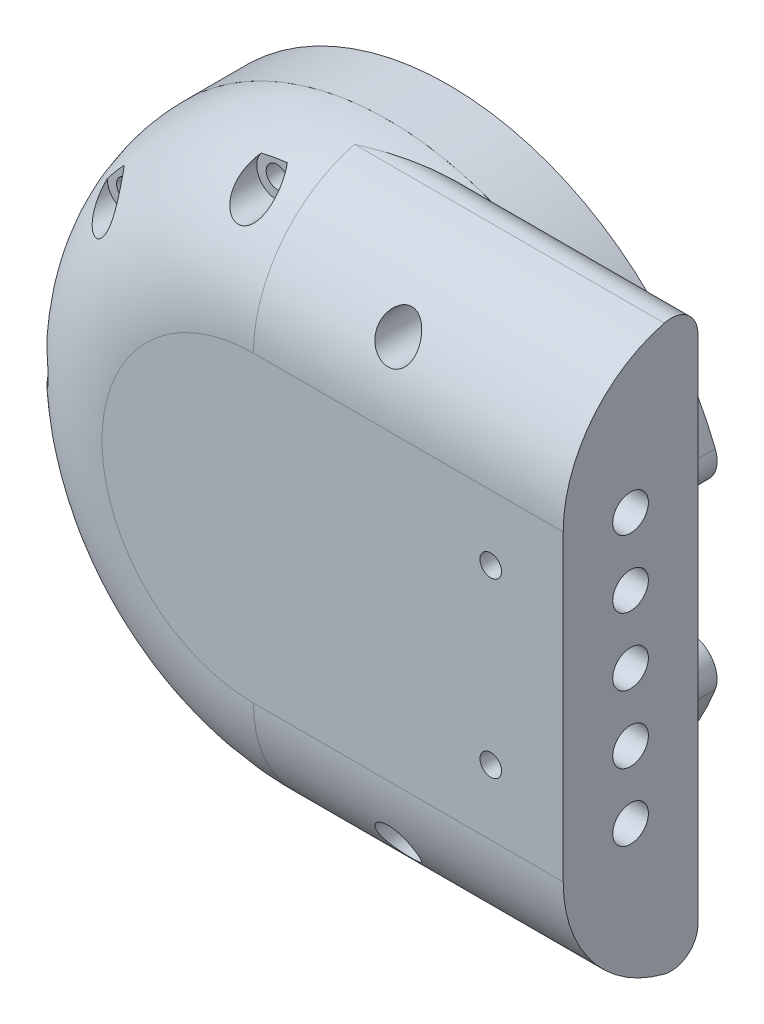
ISO-10303-21;
HEADER;
FILE_DESCRIPTION(('STEP AP214'),'2;1');
FILE_NAME('part.step','',(''),(''),'','','');
FILE_SCHEMA(('AUTOMOTIVE_DESIGN { 1 0 10303 214 1 1 1 1 }'));
ENDSEC;
DATA;
#1=APPLICATION_CONTEXT('core data for automotive mechanical design processes');
#2=APPLICATION_PROTOCOL_DEFINITION('international standard','automotive_design',2000,#1);
#3=PRODUCT_CONTEXT('',#1,'mechanical');
#4=PRODUCT('Part','Part','',(#3));
#5=PRODUCT_RELATED_PRODUCT_CATEGORY('part','',(#4));
#6=PRODUCT_DEFINITION_FORMATION('','',#4);
#7=PRODUCT_DEFINITION_CONTEXT('part definition',#1,'design');
#8=PRODUCT_DEFINITION('design','',#6,#7);
#9=PRODUCT_DEFINITION_SHAPE('','',#8);
#10=(LENGTH_UNIT() NAMED_UNIT(*) SI_UNIT(.MILLI.,.METRE.));
#11=(NAMED_UNIT(*) PLANE_ANGLE_UNIT() SI_UNIT($,.RADIAN.));
#12=(NAMED_UNIT(*) SI_UNIT($,.STERADIAN.) SOLID_ANGLE_UNIT());
#13=UNCERTAINTY_MEASURE_WITH_UNIT(LENGTH_MEASURE(1.E-05),#10,'distance_accuracy_value','');
#14=(GEOMETRIC_REPRESENTATION_CONTEXT(3) GLOBAL_UNCERTAINTY_ASSIGNED_CONTEXT((#13)) GLOBAL_UNIT_ASSIGNED_CONTEXT((#10,
#11,#12)) REPRESENTATION_CONTEXT('',''));
#15=CARTESIAN_POINT('',(0.,0.,0.));
#16=DIRECTION('',(0.,0.,1.));
#17=DIRECTION('',(1.,0.,0.));
#18=AXIS2_PLACEMENT_3D('',#15,#16,#17);
#19=CARTESIAN_POINT('',(46.,37.9919333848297,9.));
#20=DIRECTION('',(0.,0.,-1.));
#21=DIRECTION('',(-1.,0.,0.));
#22=AXIS2_PLACEMENT_3D('',#19,#20,#21);
#23=PLANE('',#22);
#24=CARTESIAN_POINT('',(0.,0.,9.));
#25=DIRECTION('',(0.,0.,1.));
#26=DIRECTION('',(1.,0.,0.));
#27=AXIS2_PLACEMENT_3D('',#24,#25,#26);
#28=CIRCLE('',#27,42.5);
#29=CARTESIAN_POINT('',(19.0489631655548,-37.9919333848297,9.));
#30=VERTEX_POINT('',#29);
#31=CARTESIAN_POINT('',(19.0489631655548,37.9919333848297,9.));
#32=VERTEX_POINT('',#31);
#33=EDGE_CURVE('E53',#30,#32,#28,.F.);
#34=ORIENTED_EDGE('',*,*,#33,.T.);
#35=DIRECTION('',(-1.,0.,0.));
#36=VECTOR('',#35,1.);
#37=CARTESIAN_POINT('',(51.,37.9919333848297,9.));
#38=LINE('',#37,#36);
#39=CARTESIAN_POINT('',(46.,37.9919333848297,9.));
#40=VERTEX_POINT('',#39);
#41=EDGE_CURVE('E376',#32,#40,#38,.F.);
#42=ORIENTED_EDGE('',*,*,#41,.T.);
#43=DIRECTION('',(0.,-1.,0.));
#44=VECTOR('',#43,1.);
#45=CARTESIAN_POINT('',(46.,0.,9.));
#46=LINE('',#45,#44);
#47=CARTESIAN_POINT('',(46.,-37.9919333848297,9.));
#48=VERTEX_POINT('',#47);
#49=EDGE_CURVE('E494',#40,#48,#46,.T.);
#50=ORIENTED_EDGE('',*,*,#49,.T.);
#51=DIRECTION('',(1.,0.,0.));
#52=VECTOR('',#51,1.);
#53=CARTESIAN_POINT('',(0.,-37.9919333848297,9.));
#54=LINE('',#53,#52);
#55=EDGE_CURVE('E373',#48,#30,#54,.F.);
#56=ORIENTED_EDGE('',*,*,#55,.T.);
#57=EDGE_LOOP('',(#34,#42,#50,#56));
#58=FACE_BOUND('',#57,.T.);
#59=CARTESIAN_POINT('',(35.2384732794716,12.8257553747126,9.));
#60=DIRECTION('',(0.,0.,-1.));
#61=DIRECTION('',(-1.,0.,0.));
#62=AXIS2_PLACEMENT_3D('',#59,#60,#61);
#63=CIRCLE('',#62,1.6);
#64=CARTESIAN_POINT('',(33.6384732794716,12.8257553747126,9.));
#65=VERTEX_POINT('',#64);
#66=EDGE_CURVE('E141',#65,#65,#63,.T.);
#67=ORIENTED_EDGE('',*,*,#66,.F.);
#68=EDGE_LOOP('',(#67));
#69=FACE_BOUND('',#68,.T.);
#70=CARTESIAN_POINT('',(35.2384732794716,-12.8257553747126,9.));
#71=DIRECTION('',(0.,0.,-1.));
#72=DIRECTION('',(-1.,0.,0.));
#73=AXIS2_PLACEMENT_3D('',#70,#71,#72);
#74=CIRCLE('',#73,1.6);
#75=CARTESIAN_POINT('',(33.6384732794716,-12.8257553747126,9.));
#76=VERTEX_POINT('',#75);
#77=EDGE_CURVE('E458',#76,#76,#74,.T.);
#78=ORIENTED_EDGE('',*,*,#77,.F.);
#79=EDGE_LOOP('',(#78));
#80=FACE_BOUND('',#79,.T.);
#81=CARTESIAN_POINT('',(18.75,-32.4759526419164,9.));
#82=DIRECTION('',(0.,0.,-1.));
#83=DIRECTION('',(-1.,0.,0.));
#84=AXIS2_PLACEMENT_3D('',#81,#82,#83);
#85=CIRCLE('',#84,1.6);
#86=CARTESIAN_POINT('',(17.15,-32.4759526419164,9.));
#87=VERTEX_POINT('',#86);
#88=EDGE_CURVE('E461',#87,#87,#85,.T.);
#89=ORIENTED_EDGE('',*,*,#88,.F.);
#90=EDGE_LOOP('',(#89));
#91=FACE_BOUND('',#90,.T.);
#92=CARTESIAN_POINT('',(18.75,32.4759526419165,9.));
#93=DIRECTION('',(0.,0.,-1.));
#94=DIRECTION('',(-1.,0.,0.));
#95=AXIS2_PLACEMENT_3D('',#92,#93,#94);
#96=CIRCLE('',#95,1.59999999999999);
#97=CARTESIAN_POINT('',(17.15,32.4759526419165,9.));
#98=VERTEX_POINT('',#97);
#99=EDGE_CURVE('E464',#98,#98,#96,.T.);
#100=ORIENTED_EDGE('',*,*,#99,.F.);
#101=EDGE_LOOP('',(#100));
#102=FACE_BOUND('',#101,.T.);
#103=CARTESIAN_POINT('',(-28.7266666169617,-24.1045353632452,9.));
#104=DIRECTION('',(0.,0.,-1.));
#105=DIRECTION('',(-1.,0.,0.));
#106=AXIS2_PLACEMENT_3D('',#103,#104,#105);
#107=CIRCLE('',#106,1.6);
#108=CARTESIAN_POINT('',(-30.3266666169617,-24.1045353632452,9.));
#109=VERTEX_POINT('',#108);
#110=EDGE_CURVE('E467',#109,#109,#107,.T.);
#111=ORIENTED_EDGE('',*,*,#110,.F.);
#112=EDGE_LOOP('',(#111));
#113=FACE_BOUND('',#112,.T.);
#114=CARTESIAN_POINT('',(-6.51180666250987,-36.9302907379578,9.));
#115=DIRECTION('',(0.,0.,-1.));
#116=DIRECTION('',(-1.,0.,0.));
#117=AXIS2_PLACEMENT_3D('',#114,#115,#116);
#118=CIRCLE('',#117,1.6);
#119=CARTESIAN_POINT('',(-8.11180666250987,-36.9302907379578,9.));
#120=VERTEX_POINT('',#119);
#121=EDGE_CURVE('E470',#120,#120,#118,.T.);
#122=ORIENTED_EDGE('',*,*,#121,.F.);
#123=EDGE_LOOP('',(#122));
#124=FACE_BOUND('',#123,.T.);
#125=CARTESIAN_POINT('',(-37.5,0.,9.));
#126=DIRECTION('',(0.,0.,-1.));
#127=DIRECTION('',(-1.,0.,0.));
#128=AXIS2_PLACEMENT_3D('',#125,#126,#127);
#129=CIRCLE('',#128,1.6);
#130=CARTESIAN_POINT('',(-39.1,0.,9.));
#131=VERTEX_POINT('',#130);
#132=EDGE_CURVE('E473',#131,#131,#129,.T.);
#133=ORIENTED_EDGE('',*,*,#132,.F.);
#134=EDGE_LOOP('',(#133));
#135=FACE_BOUND('',#134,.T.);
#136=CARTESIAN_POINT('',(-28.7266666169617,24.1045353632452,9.));
#137=DIRECTION('',(0.,0.,-1.));
#138=DIRECTION('',(-1.,0.,0.));
#139=AXIS2_PLACEMENT_3D('',#136,#137,#138);
#140=CIRCLE('',#139,1.6);
#141=CARTESIAN_POINT('',(-30.3266666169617,24.1045353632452,9.));
#142=VERTEX_POINT('',#141);
#143=EDGE_CURVE('E476',#142,#142,#140,.T.);
#144=ORIENTED_EDGE('',*,*,#143,.F.);
#145=EDGE_LOOP('',(#144));
#146=FACE_BOUND('',#145,.T.);
#147=CARTESIAN_POINT('',(-6.51180666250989,36.9302907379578,9.));
#148=DIRECTION('',(0.,0.,-1.));
#149=DIRECTION('',(-1.,0.,0.));
#150=AXIS2_PLACEMENT_3D('',#147,#148,#149);
#151=CIRCLE('',#150,1.6);
#152=CARTESIAN_POINT('',(-8.11180666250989,36.9302907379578,9.));
#153=VERTEX_POINT('',#152);
#154=EDGE_CURVE('E478',#153,#153,#151,.T.);
#155=ORIENTED_EDGE('',*,*,#154,.F.);
#156=EDGE_LOOP('',(#155));
#157=FACE_BOUND('',#156,.T.);
#158=ADVANCED_FACE('F49',(#58,#69,#80,#91,#102,#113,#124,#135,#146,#157),#23,.T.);
#159=CARTESIAN_POINT('',(40.,-20.,19.));
#160=DIRECTION('',(1.,0.,0.));
#161=DIRECTION('',(0.,0.,-1.));
#162=AXIS2_PLACEMENT_3D('',#159,#160,#161);
#163=PLANE('',#162);
#164=CARTESIAN_POINT('',(40.,-20.,19.));
#165=DIRECTION('',(1.,0.,0.));
#166=DIRECTION('',(0.,1.,0.));
#167=AXIS2_PLACEMENT_3D('',#164,#165,#166);
#168=CIRCLE('',#167,2.65);
#169=CARTESIAN_POINT('',(40.,-17.35,19.));
#170=VERTEX_POINT('',#169);
#171=EDGE_CURVE('E402',#170,#170,#168,.T.);
#172=ORIENTED_EDGE('',*,*,#171,.T.);
#173=EDGE_LOOP('',(#172));
#174=FACE_BOUND('',#173,.T.);
#175=ADVANCED_FACE('F215',(#174),#163,.T.);
#176=CARTESIAN_POINT('',(40.,-10.,19.));
#177=DIRECTION('',(1.,0.,0.));
#178=DIRECTION('',(0.,0.,-1.));
#179=AXIS2_PLACEMENT_3D('',#176,#177,#178);
#180=PLANE('',#179);
#181=CARTESIAN_POINT('',(40.,-10.,19.));
#182=DIRECTION('',(1.,0.,0.));
#183=DIRECTION('',(0.,1.,0.));
#184=AXIS2_PLACEMENT_3D('',#181,#182,#183);
#185=CIRCLE('',#184,2.65);
#186=CARTESIAN_POINT('',(40.,-7.35,19.));
#187=VERTEX_POINT('',#186);
#188=EDGE_CURVE('E408',#187,#187,#185,.T.);
#189=ORIENTED_EDGE('',*,*,#188,.T.);
#190=EDGE_LOOP('',(#189));
#191=FACE_BOUND('',#190,.T.);
#192=ADVANCED_FACE('F256',(#191),#180,.T.);
#193=CARTESIAN_POINT('',(40.,0.,19.));
#194=DIRECTION('',(1.,0.,0.));
#195=DIRECTION('',(0.,0.,-1.));
#196=AXIS2_PLACEMENT_3D('',#193,#194,#195);
#197=PLANE('',#196);
#198=CARTESIAN_POINT('',(40.,0.,19.));
#199=DIRECTION('',(1.,0.,0.));
#200=DIRECTION('',(0.,1.,0.));
#201=AXIS2_PLACEMENT_3D('',#198,#199,#200);
#202=CIRCLE('',#201,2.65);
#203=CARTESIAN_POINT('',(40.,2.65,19.));
#204=VERTEX_POINT('',#203);
#205=EDGE_CURVE('E414',#204,#204,#202,.T.);
#206=ORIENTED_EDGE('',*,*,#205,.T.);
#207=EDGE_LOOP('',(#206));
#208=FACE_BOUND('',#207,.T.);
#209=ADVANCED_FACE('F262',(#208),#197,.T.);
#210=CARTESIAN_POINT('',(40.,10.,19.));
#211=DIRECTION('',(1.,0.,0.));
#212=DIRECTION('',(0.,0.,-1.));
#213=AXIS2_PLACEMENT_3D('',#210,#211,#212);
#214=PLANE('',#213);
#215=CARTESIAN_POINT('',(40.,10.,19.));
#216=DIRECTION('',(1.,0.,0.));
#217=DIRECTION('',(0.,1.,0.));
#218=AXIS2_PLACEMENT_3D('',#215,#216,#217);
#219=CIRCLE('',#218,2.65);
#220=CARTESIAN_POINT('',(40.,12.65,19.));
#221=VERTEX_POINT('',#220);
#222=EDGE_CURVE('E420',#221,#221,#219,.T.);
#223=ORIENTED_EDGE('',*,*,#222,.T.);
#224=EDGE_LOOP('',(#223));
#225=FACE_BOUND('',#224,.T.);
#226=ADVANCED_FACE('F273',(#225),#214,.T.);
#227=CARTESIAN_POINT('',(40.,20.,19.));
#228=DIRECTION('',(1.,0.,0.));
#229=DIRECTION('',(0.,0.,-1.));
#230=AXIS2_PLACEMENT_3D('',#227,#228,#229);
#231=PLANE('',#230);
#232=CARTESIAN_POINT('',(40.,20.,19.));
#233=DIRECTION('',(1.,0.,0.));
#234=DIRECTION('',(0.,1.,0.));
#235=AXIS2_PLACEMENT_3D('',#232,#233,#234);
#236=CIRCLE('',#235,2.65);
#237=CARTESIAN_POINT('',(40.,22.65,19.));
#238=VERTEX_POINT('',#237);
#239=EDGE_CURVE('E390',#238,#238,#236,.T.);
#240=ORIENTED_EDGE('',*,*,#239,.T.);
#241=EDGE_LOOP('',(#240));
#242=FACE_BOUND('',#241,.T.);
#243=ADVANCED_FACE('F269',(#242),#231,.T.);
#244=CARTESIAN_POINT('',(18.7508502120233,32.4754617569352,29.));
#245=DIRECTION('',(0.,0.,-1.));
#246=DIRECTION('',(-1.,0.,0.));
#247=AXIS2_PLACEMENT_3D('',#244,#245,#246);
#248=CYLINDRICAL_SURFACE('',#247,3.);
#249=CARTESIAN_POINT('',(15.7508502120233,32.4754617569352,26.3346520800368));
#250=CARTESIAN_POINT('',(15.7508566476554,32.6970317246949,26.2071360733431));
#251=CARTESIAN_POINT('',(15.7754238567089,32.9163204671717,26.0752241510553));
#252=CARTESIAN_POINT('',(15.8706116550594,33.3427273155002,25.8077050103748));
#253=CARTESIAN_POINT('',(15.9413351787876,33.5498170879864,25.6720901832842));
#254=CARTESIAN_POINT('',(16.1168233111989,33.9246670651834,25.4171551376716));
#255=CARTESIAN_POINT('',(16.2173096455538,34.0942796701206,25.2976005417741));
#256=CARTESIAN_POINT('',(16.4523335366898,34.4134996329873,25.0657168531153));
#257=CARTESIAN_POINT('',(16.5868064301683,34.5631441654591,24.9533745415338));
#258=CARTESIAN_POINT('',(16.8503217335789,34.801616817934,24.7698076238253));
#259=CARTESIAN_POINT('',(16.9719572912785,34.8962107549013,24.6954152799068));
#260=CARTESIAN_POINT('',(17.2329710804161,35.0678249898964,24.5583352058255));
#261=CARTESIAN_POINT('',(17.3723244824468,35.1448694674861,24.4956313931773));
#262=CARTESIAN_POINT('',(17.6408008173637,35.2657066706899,24.3961609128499));
#263=CARTESIAN_POINT('',(17.7673791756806,35.3129696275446,24.3567688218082));
#264=CARTESIAN_POINT('',(18.0290278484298,35.3905163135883,24.2917353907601));
#265=CARTESIAN_POINT('',(18.1640920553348,35.4208121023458,24.2660842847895));
#266=CARTESIAN_POINT('',(18.4399224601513,35.4625780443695,24.2306387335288));
#267=CARTESIAN_POINT('',(18.5807143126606,35.4739510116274,24.2209261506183));
#268=CARTESIAN_POINT('',(18.8626332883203,35.4766887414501,24.2185925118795));
#269=CARTESIAN_POINT('',(19.003760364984,35.4680561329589,24.2259692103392));
#270=CARTESIAN_POINT('',(19.2699920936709,35.432998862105,24.2557525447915));
#271=CARTESIAN_POINT('',(19.3954542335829,35.4081107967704,24.2768605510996));
#272=CARTESIAN_POINT('',(19.6397189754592,35.3435420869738,24.3311837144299));
#273=CARTESIAN_POINT('',(19.7585203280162,35.3038586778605,24.3644011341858));
#274=CARTESIAN_POINT('',(19.9962747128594,35.2079690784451,24.4438227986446));
#275=CARTESIAN_POINT('',(20.1145365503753,35.1507267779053,24.4908294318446));
#276=CARTESIAN_POINT('',(20.3396812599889,35.0234755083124,24.5938860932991));
#277=CARTESIAN_POINT('',(20.4465547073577,34.9534560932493,24.6499435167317));
#278=CARTESIAN_POINT('',(20.6957981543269,34.7670757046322,24.7967936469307));
#279=CARTESIAN_POINT('',(20.8311818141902,34.6444199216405,24.891511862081));
#280=CARTESIAN_POINT('',(21.0751180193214,34.3807525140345,25.0895933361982));
#281=CARTESIAN_POINT('',(21.1836299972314,34.2397136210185,25.1929693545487));
#282=CARTESIAN_POINT('',(21.374276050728,33.9415021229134,25.4050557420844));
#283=CARTESIAN_POINT('',(21.4561070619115,33.7841692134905,25.5138122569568));
#284=CARTESIAN_POINT('',(21.5908504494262,33.4580691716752,25.7319819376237));
#285=CARTESIAN_POINT('',(21.6437661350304,33.2893033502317,25.8413950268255));
#286=CARTESIAN_POINT('',(21.7238314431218,32.9232407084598,26.0706756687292));
#287=CARTESIAN_POINT('',(21.7472105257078,32.7249251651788,26.190256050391));
#288=CARTESIAN_POINT('',(21.753698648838,32.3234373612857,26.4227929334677));
#289=CARTESIAN_POINT('',(21.7368024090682,32.1202644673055,26.5357485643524));
#290=CARTESIAN_POINT('',(21.680480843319,31.8220565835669,26.6949534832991));
#291=CARTESIAN_POINT('',(21.6574037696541,31.725893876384,26.7452651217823));
#292=CARTESIAN_POINT('',(21.6013873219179,31.5350867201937,26.8431682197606));
#293=CARTESIAN_POINT('',(21.5684531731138,31.4404414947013,26.8907611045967));
#294=CARTESIAN_POINT('',(21.4926562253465,31.253720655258,26.9828590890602));
#295=CARTESIAN_POINT('',(21.4497983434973,31.1616437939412,27.0273657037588));
#296=CARTESIAN_POINT('',(21.3541889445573,30.9811212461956,27.1129941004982));
#297=CARTESIAN_POINT('',(21.3014389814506,30.8926749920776,27.1541164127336));
#298=CARTESIAN_POINT('',(21.1932099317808,30.7309942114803,27.2279361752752));
#299=CARTESIAN_POINT('',(21.138830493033,30.6572128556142,27.2610512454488));
#300=CARTESIAN_POINT('',(21.022834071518,30.5141955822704,27.324267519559));
#301=CARTESIAN_POINT('',(20.9612181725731,30.4449589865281,27.3543691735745));
#302=CARTESIAN_POINT('',(20.8311329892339,30.311883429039,27.4114018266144));
#303=CARTESIAN_POINT('',(20.7626673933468,30.2480415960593,27.4383345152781));
#304=CARTESIAN_POINT('',(20.6193808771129,30.126540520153,27.4889213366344));
#305=CARTESIAN_POINT('',(20.5445605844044,30.0688806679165,27.5125757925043));
#306=CARTESIAN_POINT('',(20.3283855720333,29.9181631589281,27.5736832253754));
#307=CARTESIAN_POINT('',(20.1806452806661,29.8325652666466,27.6075119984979));
#308=CARTESIAN_POINT('',(19.8711217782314,29.6872294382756,27.6641335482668));
#309=CARTESIAN_POINT('',(19.7093444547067,29.6274807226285,27.6869309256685));
#310=CARTESIAN_POINT('',(19.3872392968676,29.5392866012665,27.7203238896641));
#311=CARTESIAN_POINT('',(19.2274521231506,29.5091190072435,27.7315926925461));
#312=CARTESIAN_POINT('',(18.9047314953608,29.4750222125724,27.7443168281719));
#313=CARTESIAN_POINT('',(18.7417986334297,29.471088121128,27.745773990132));
#314=CARTESIAN_POINT('',(18.4215555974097,29.4893816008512,27.7389600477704));
#315=CARTESIAN_POINT('',(18.2642042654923,29.5109842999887,27.7309213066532));
#316=CARTESIAN_POINT('',(17.9555965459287,29.5784775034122,27.7055190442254));
#317=CARTESIAN_POINT('',(17.8043399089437,29.6243670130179,27.6881559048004));
#318=CARTESIAN_POINT('',(17.511565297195,29.7388647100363,27.6441032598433));
#319=CARTESIAN_POINT('',(17.3700813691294,29.8075479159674,27.6173829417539));
#320=CARTESIAN_POINT('',(17.1010293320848,29.9650046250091,27.554806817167));
#321=CARTESIAN_POINT('',(16.9734619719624,30.053779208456,27.5189505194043));
#322=CARTESIAN_POINT('',(16.7315829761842,30.2511322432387,27.4372356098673));
#323=CARTESIAN_POINT('',(16.6177789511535,30.3602215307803,27.3911110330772));
#324=CARTESIAN_POINT('',(16.4101996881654,30.5924757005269,27.2901028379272));
#325=CARTESIAN_POINT('',(16.3164312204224,30.7156453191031,27.2352162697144));
#326=CARTESIAN_POINT('',(16.145016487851,30.9801370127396,27.1137992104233));
#327=CARTESIAN_POINT('',(16.068746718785,31.1221127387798,27.0467549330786));
#328=CARTESIAN_POINT('',(15.9408048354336,31.4129670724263,26.9048928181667));
#329=CARTESIAN_POINT('',(15.8891277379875,31.5618442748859,26.830076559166));
#330=CARTESIAN_POINT('',(15.816313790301,31.8385985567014,26.6864606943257));
#331=CARTESIAN_POINT('',(15.7916261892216,31.9660484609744,26.6185975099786));
#332=CARTESIAN_POINT('',(15.7588895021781,32.2210686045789,26.4791878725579));
#333=CARTESIAN_POINT('',(15.7508465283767,32.3486388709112,26.4076400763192));
#334=CARTESIAN_POINT('',(15.7508502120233,32.4754617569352,26.3346520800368));
#335=B_SPLINE_CURVE_WITH_KNOTS('',3,(#249,#250,#251,#252,#253,#254,#255,#256,#257,#258,#259,
#260,#261,#262,#263,#264,#265,#266,#267,#268,#269,#270,#271,#272,#273,#274,#275,#276,#277,#278,
#279,#280,#281,#282,#283,#284,#285,#286,#287,#288,#289,#290,#291,#292,#293,#294,#295,#296,#297,
#298,#299,#300,#301,#302,#303,#304,#305,#306,#307,#308,#309,#310,#311,#312,#313,#314,#315,#316,
#317,#318,#319,#320,#321,#322,#323,#324,#325,#326,#327,#328,#329,#330,#331,#332,#333,#334),
.UNSPECIFIED.,.T.,.F.,(4,2,2,2,2,2,2,2,2,2,2,2,2,2,2,2,2,2,2,2,2,2,2,2,2,2,2,2,2,2,2,2,2,2,2,2,
2,2,2,2,2,2,4),(0.,0.76626691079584,1.53424856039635,2.22278490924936,2.91002097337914,
3.42149547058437,3.93226093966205,4.35275736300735,4.77295453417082,5.19530321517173,
5.61759639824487,6.00483075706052,6.39213751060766,6.80923486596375,7.22667476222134,
7.84070517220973,8.4556569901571,9.07736852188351,9.69900888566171,10.3938946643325,
11.0888715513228,11.4213453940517,11.7536433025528,12.0857769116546,12.4178583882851,
12.7098199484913,13.001737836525,13.2934993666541,13.5852321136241,14.1044618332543,
14.6234748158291,15.1100685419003,15.5965715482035,16.0714123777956,16.5462337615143,
17.02263363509,17.4990591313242,17.9896662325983,18.48043885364,19.0019301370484,
19.5233157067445,19.9617528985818,20.4003510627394),.UNSPECIFIED.);
#336=CARTESIAN_POINT('',(15.7508502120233,32.4754617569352,26.3346520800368));
#337=VERTEX_POINT('',#336);
#338=EDGE_CURVE('E336',#337,#337,#335,.T.);
#339=ORIENTED_EDGE('',*,*,#338,.F.);
#340=EDGE_LOOP('',(#339));
#341=FACE_BOUND('',#340,.T.);
#342=CARTESIAN_POINT('',(18.7508502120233,32.4754617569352,19.));
#343=DIRECTION('',(0.,0.,1.));
#344=DIRECTION('',(1.,0.,0.));
#345=AXIS2_PLACEMENT_3D('',#342,#343,#344);
#346=CIRCLE('',#345,3.);
#347=CARTESIAN_POINT('',(21.7508502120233,32.4754617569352,19.));
#348=VERTEX_POINT('',#347);
#349=EDGE_CURVE('E452',#348,#348,#346,.T.);
#350=ORIENTED_EDGE('',*,*,#349,.F.);
#351=EDGE_LOOP('',(#350));
#352=FACE_BOUND('',#351,.T.);
#353=ADVANCED_FACE('F272',(#341,#352),#248,.F.);
#354=CARTESIAN_POINT('',(18.75,-32.4759526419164,29.));
#355=DIRECTION('',(0.,0.,-1.));
#356=DIRECTION('',(-1.,0.,0.));
#357=AXIS2_PLACEMENT_3D('',#354,#355,#356);
#358=CYLINDRICAL_SURFACE('',#357,3.);
#359=CARTESIAN_POINT('',(15.75,-32.4759526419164,26.3343695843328));
#360=CARTESIAN_POINT('',(15.7500024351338,-32.2989450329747,26.4362372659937));
#361=CARTESIAN_POINT('',(15.7656730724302,-32.1203334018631,26.5353899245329));
#362=CARTESIAN_POINT('',(15.8299320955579,-31.7647440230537,26.7258331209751));
#363=CARTESIAN_POINT('',(15.878515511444,-31.5877660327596,26.8171248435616));
#364=CARTESIAN_POINT('',(16.0098791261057,-31.2404900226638,26.9900432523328));
#365=CARTESIAN_POINT('',(16.092840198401,-31.0702326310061,27.0716158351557));
#366=CARTESIAN_POINT('',(16.2925558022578,-30.7446635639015,27.2224507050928));
#367=CARTESIAN_POINT('',(16.4092910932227,-30.5893434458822,27.2917199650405));
#368=CARTESIAN_POINT('',(16.6606069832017,-30.3160098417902,27.4100506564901));
#369=CARTESIAN_POINT('',(16.7921821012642,-30.1958110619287,27.4604482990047));
#370=CARTESIAN_POINT('',(17.0771768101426,-29.9792285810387,27.54925545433));
#371=CARTESIAN_POINT('',(17.2305835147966,-29.8828309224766,27.5876719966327));
#372=CARTESIAN_POINT('',(17.5398170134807,-29.7258970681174,27.6492065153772));
#373=CARTESIAN_POINT('',(17.6942012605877,-29.6629252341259,27.6733851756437));
#374=CARTESIAN_POINT('',(18.012439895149,-29.5632605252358,27.7113127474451));
#375=CARTESIAN_POINT('',(18.1762913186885,-29.5265594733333,27.7250649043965));
#376=CARTESIAN_POINT('',(18.5008136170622,-29.4820386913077,27.7417094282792));
#377=CARTESIAN_POINT('',(18.6612932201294,-29.4729878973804,27.7450647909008));
#378=CARTESIAN_POINT('',(18.981544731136,-29.4806178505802,27.7422248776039));
#379=CARTESIAN_POINT('',(19.1413167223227,-29.4972954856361,27.7360307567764));
#380=CARTESIAN_POINT('',(19.4535840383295,-29.5553559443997,27.7142427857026));
#381=CARTESIAN_POINT('',(19.6061446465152,-29.5964327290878,27.6987653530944));
#382=CARTESIAN_POINT('',(19.9018664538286,-29.701457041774,27.6585679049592));
#383=CARTESIAN_POINT('',(20.0450276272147,-29.7654046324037,27.6338478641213));
#384=CARTESIAN_POINT('',(20.3200926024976,-29.9147750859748,27.5749188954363));
#385=CARTESIAN_POINT('',(20.4518192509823,-30.0004750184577,27.54058690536));
#386=CARTESIAN_POINT('',(20.6986990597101,-30.1897377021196,27.4628918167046));
#387=CARTESIAN_POINT('',(20.8138500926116,-30.2933027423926,27.4195275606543));
#388=CARTESIAN_POINT('',(21.0297467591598,-30.5193746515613,27.3222641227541));
#389=CARTESIAN_POINT('',(21.129684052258,-30.6424944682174,27.2679989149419));
#390=CARTESIAN_POINT('',(21.3075469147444,-30.9000486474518,27.1510107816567));
#391=CARTESIAN_POINT('',(21.3854663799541,-31.0344861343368,27.088285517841));
#392=CARTESIAN_POINT('',(21.5237863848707,-31.3212446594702,26.9502874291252));
#393=CARTESIAN_POINT('',(21.5823861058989,-31.474146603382,26.8744213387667));
#394=CARTESIAN_POINT('',(21.673553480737,-31.7838993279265,26.7155176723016));
#395=CARTESIAN_POINT('',(21.7061099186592,-31.9407517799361,26.6324770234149));
#396=CARTESIAN_POINT('',(21.7481594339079,-32.2715800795,26.4515174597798));
#397=CARTESIAN_POINT('',(21.7547748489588,-32.4455717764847,26.3529610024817));
#398=CARTESIAN_POINT('',(21.7385411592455,-32.7894646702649,26.1512894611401));
#399=CARTESIAN_POINT('',(21.7156802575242,-32.9593642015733,26.048172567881));
#400=CARTESIAN_POINT('',(21.6378893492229,-33.3101469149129,25.8281962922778));
#401=CARTESIAN_POINT('',(21.5796701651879,-33.4901448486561,25.7110858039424));
#402=CARTESIAN_POINT('',(21.4301644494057,-33.83699149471,25.477752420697));
#403=CARTESIAN_POINT('',(21.3388353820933,-34.0038229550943,25.3615308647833));
#404=CARTESIAN_POINT('',(21.1753822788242,-34.2444290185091,25.1888487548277));
#405=CARTESIAN_POINT('',(21.1148179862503,-34.3246905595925,25.1302812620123));
#406=CARTESIAN_POINT('',(20.9850154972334,-34.4796856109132,25.0155065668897));
#407=CARTESIAN_POINT('',(20.9157756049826,-34.5544180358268,24.959299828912));
#408=CARTESIAN_POINT('',(20.6953819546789,-34.7688367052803,24.7958103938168));
#409=CARTESIAN_POINT('',(20.5311425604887,-34.8993609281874,24.6932110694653));
#410=CARTESIAN_POINT('',(20.2333361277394,-35.0872875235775,24.5425025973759));
#411=CARTESIAN_POINT('',(20.1090226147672,-35.1543213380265,24.4878636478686));
#412=CARTESIAN_POINT('',(19.8478844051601,-35.2714864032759,24.3913899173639));
#413=CARTESIAN_POINT('',(19.7110720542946,-35.3216341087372,24.3495426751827));
#414=CARTESIAN_POINT('',(19.4982116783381,-35.3821048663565,24.2987604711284));
#415=CARTESIAN_POINT('',(19.425613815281,-35.3998528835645,24.2837882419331));
#416=CARTESIAN_POINT('',(19.2785567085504,-35.4299749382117,24.25831376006));
#417=CARTESIAN_POINT('',(19.20409845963,-35.4423517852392,24.2478091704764));
#418=CARTESIAN_POINT('',(19.0539713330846,-35.4614716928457,24.2315597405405));
#419=CARTESIAN_POINT('',(18.9783029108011,-35.4682168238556,24.2258131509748));
#420=CARTESIAN_POINT('',(18.8264854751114,-35.4759421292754,24.2192294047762));
#421=CARTESIAN_POINT('',(18.7503365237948,-35.4769230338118,24.2183916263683));
#422=CARTESIAN_POINT('',(18.5420696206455,-35.4716486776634,24.2228908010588));
#423=CARTESIAN_POINT('',(18.4101324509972,-35.4595170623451,24.2332425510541));
#424=CARTESIAN_POINT('',(18.1509356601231,-35.4184667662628,24.268068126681));
#425=CARTESIAN_POINT('',(18.0236765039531,-35.3895464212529,24.2925433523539));
#426=CARTESIAN_POINT('',(17.7764122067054,-35.3165140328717,24.3538015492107));
#427=CARTESIAN_POINT('',(17.6564262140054,-35.2723637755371,24.3906154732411));
#428=CARTESIAN_POINT('',(17.4259277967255,-35.1708972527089,24.4742588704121));
#429=CARTESIAN_POINT('',(17.3154214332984,-35.1135726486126,24.521094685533));
#430=CARTESIAN_POINT('',(17.0589302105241,-34.9601664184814,24.6447328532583));
#431=CARTESIAN_POINT('',(16.9185164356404,-34.8580899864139,24.7256914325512));
#432=CARTESIAN_POINT('',(16.6606153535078,-34.6354881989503,24.8981070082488));
#433=CARTESIAN_POINT('',(16.5431654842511,-34.5149332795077,24.9895807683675));
#434=CARTESIAN_POINT('',(16.3302845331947,-34.2573175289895,25.1799715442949));
#435=CARTESIAN_POINT('',(16.2351783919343,-34.12005254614,25.2789736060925));
#436=CARTESIAN_POINT('',(16.0695860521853,-33.8334402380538,25.4797987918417));
#437=CARTESIAN_POINT('',(15.9990930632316,-33.6840962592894,25.5816211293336));
#438=CARTESIAN_POINT('',(15.878617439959,-33.3630530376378,25.7938704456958));
#439=CARTESIAN_POINT('',(15.83083701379,-33.1905282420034,25.9043064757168));
#440=CARTESIAN_POINT('',(15.7665252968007,-32.8378845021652,26.1222398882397));
#441=CARTESIAN_POINT('',(15.7499974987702,-32.6577647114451,26.229736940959));
#442=CARTESIAN_POINT('',(15.75,-32.4759526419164,26.3343695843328));
#443=B_SPLINE_CURVE_WITH_KNOTS('',3,(#359,#360,#361,#362,#363,#364,#365,#366,#367,#368,#369,
#370,#371,#372,#373,#374,#375,#376,#377,#378,#379,#380,#381,#382,#383,#384,#385,#386,#387,#388,
#389,#390,#391,#392,#393,#394,#395,#396,#397,#398,#399,#400,#401,#402,#403,#404,#405,#406,#407,
#408,#409,#410,#411,#412,#413,#414,#415,#416,#417,#418,#419,#420,#421,#422,#423,#424,#425,#426,
#427,#428,#429,#430,#431,#432,#433,#434,#435,#436,#437,#438,#439,#440,#441,#442),.UNSPECIFIED.,
.T.,.F.,(4,2,2,2,2,2,2,2,2,2,2,2,2,2,2,2,2,2,2,2,2,2,2,2,2,2,2,2,2,2,2,2,2,2,2,2,2,2,2,2,2,4),
(0.,0.612040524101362,1.22398864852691,1.83919818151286,2.45405792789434,3.00663460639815,
3.55888646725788,4.06176498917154,4.56448691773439,5.04447382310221,5.52440267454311,
5.99843524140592,6.47246910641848,6.95287381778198,7.43334013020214,7.93398976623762,
8.43477806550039,8.97395516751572,9.51336434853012,10.1111566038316,10.7091881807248,
11.3738489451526,12.0393666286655,12.3880157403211,12.7367331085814,13.4316070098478,
13.8843538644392,14.3366582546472,14.5650352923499,14.793292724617,15.021466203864,
15.2496107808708,15.6461738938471,16.0427763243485,16.4403812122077,16.8382384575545,
17.4097761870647,17.982238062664,18.5625707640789,19.1427432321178,19.7713259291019,
20.3999788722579),.UNSPECIFIED.);
#444=CARTESIAN_POINT('',(15.75,-32.4759526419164,26.3343695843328));
#445=VERTEX_POINT('',#444);
#446=EDGE_CURVE('E314',#445,#445,#443,.T.);
#447=ORIENTED_EDGE('',*,*,#446,.F.);
#448=EDGE_LOOP('',(#447));
#449=FACE_BOUND('',#448,.T.);
#450=CARTESIAN_POINT('',(18.75,-32.4759526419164,19.));
#451=DIRECTION('',(0.,0.,1.));
#452=DIRECTION('',(1.,0.,0.));
#453=AXIS2_PLACEMENT_3D('',#450,#451,#452);
#454=CIRCLE('',#453,3.);
#455=CARTESIAN_POINT('',(21.75,-32.4759526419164,19.));
#456=VERTEX_POINT('',#455);
#457=EDGE_CURVE('E449',#456,#456,#454,.T.);
#458=ORIENTED_EDGE('',*,*,#457,.F.);
#459=EDGE_LOOP('',(#458));
#460=FACE_BOUND('',#459,.T.);
#461=ADVANCED_FACE('F326',(#449,#460),#358,.F.);
#462=CARTESIAN_POINT('',(-37.5,0.,29.));
#463=DIRECTION('',(0.,0.,-1.));
#464=DIRECTION('',(-1.,0.,0.));
#465=AXIS2_PLACEMENT_3D('',#462,#463,#464);
#466=CYLINDRICAL_SURFACE('',#465,3.);
#467=CARTESIAN_POINT('',(-37.5,0.,19.));
#468=DIRECTION('',(0.,0.,1.));
#469=DIRECTION('',(1.,0.,0.));
#470=AXIS2_PLACEMENT_3D('',#467,#468,#469);
#471=CIRCLE('',#470,3.);
#472=CARTESIAN_POINT('',(-39.7723048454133,-1.95873190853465,19.));
#473=VERTEX_POINT('',#472);
#474=CARTESIAN_POINT('',(-39.7723048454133,1.95873190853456,19.));
#475=VERTEX_POINT('',#474);
#476=EDGE_CURVE('E12',#473,#475,#471,.T.);
#477=ORIENTED_EDGE('',*,*,#476,.F.);
#478=CARTESIAN_POINT('',(-39.7724274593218,1.95858965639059,18.9998));
#479=CARTESIAN_POINT('',(-39.7306344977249,2.00706082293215,19.0679753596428));
#480=CARTESIAN_POINT('',(-39.6878583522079,2.05357262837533,19.1369171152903));
#481=CARTESIAN_POINT('',(-39.6004785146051,2.14287431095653,19.2760059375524));
#482=CARTESIAN_POINT('',(-39.5558754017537,2.18566535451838,19.3461526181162));
#483=CARTESIAN_POINT('',(-39.464996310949,2.26771433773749,19.4873013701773));
#484=CARTESIAN_POINT('',(-39.4187219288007,2.30697552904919,19.5583025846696));
#485=CARTESIAN_POINT('',(-39.3245514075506,2.3821506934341,19.70100290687));
#486=CARTESIAN_POINT('',(-39.2766550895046,2.41806429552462,19.7727020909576));
#487=CARTESIAN_POINT('',(-39.1302668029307,2.52121672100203,19.9891243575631));
#488=CARTESIAN_POINT('',(-39.0294257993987,2.58355366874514,20.1346268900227));
#489=CARTESIAN_POINT('',(-38.8220339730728,2.69557288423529,20.42646764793));
#490=CARTESIAN_POINT('',(-38.7154812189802,2.74525083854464,20.5728061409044));
#491=CARTESIAN_POINT('',(-38.4929036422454,2.83355341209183,20.8710209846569));
#492=CARTESIAN_POINT('',(-38.3766718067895,2.87167553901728,21.02289235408));
#493=CARTESIAN_POINT('',(-38.1391034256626,2.93370347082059,21.3255349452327));
#494=CARTESIAN_POINT('',(-38.0177672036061,2.95761017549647,21.4763062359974));
#495=CARTESIAN_POINT('',(-37.7707442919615,2.99035163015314,21.7756870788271));
#496=CARTESIAN_POINT('',(-37.6450622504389,2.99920200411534,21.9242987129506));
#497=CARTESIAN_POINT('',(-37.3901408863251,3.00069472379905,22.218435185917));
#498=CARTESIAN_POINT('',(-37.2609028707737,2.99334294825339,22.3639611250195));
#499=CARTESIAN_POINT('',(-36.9483432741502,2.95454961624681,22.7075485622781));
#500=CARTESIAN_POINT('',(-36.7638107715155,2.91474433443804,22.9036718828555));
#501=CARTESIAN_POINT('',(-36.3947239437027,2.79568523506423,23.2834766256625));
#502=CARTESIAN_POINT('',(-36.2101701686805,2.71649734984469,23.4671782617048));
#503=CARTESIAN_POINT('',(-35.8922617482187,2.53770167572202,23.7742698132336));
#504=CARTESIAN_POINT('',(-35.7572997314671,2.44763384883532,23.901515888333));
#505=CARTESIAN_POINT('',(-35.4967769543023,2.23937572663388,24.1420224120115));
#506=CARTESIAN_POINT('',(-35.3712042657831,2.12122193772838,24.2553007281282));
#507=CARTESIAN_POINT('',(-35.161192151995,1.88401353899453,24.4413241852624));
#508=CARTESIAN_POINT('',(-35.0736721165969,1.77044290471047,24.5175737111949));
#509=CARTESIAN_POINT('',(-34.9128110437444,1.52571379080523,24.6560193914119));
#510=CARTESIAN_POINT('',(-34.8394650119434,1.3945615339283,24.718220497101));
#511=CARTESIAN_POINT('',(-34.7432658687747,1.1859129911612,24.7990573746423));
#512=CARTESIAN_POINT('',(-34.7133902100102,1.11399201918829,24.8240172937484));
#513=CARTESIAN_POINT('',(-34.6589624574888,0.966773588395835,24.8693052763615));
#514=CARTESIAN_POINT('',(-34.6344075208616,0.891477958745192,24.8896358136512));
#515=CARTESIAN_POINT('',(-34.5911304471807,0.738119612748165,24.9253566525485));
#516=CARTESIAN_POINT('',(-34.5724056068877,0.660058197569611,24.940749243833));
#517=CARTESIAN_POINT('',(-34.5411818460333,0.501900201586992,24.9663624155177));
#518=CARTESIAN_POINT('',(-34.5286818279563,0.421803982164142,24.9765839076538));
#519=CARTESIAN_POINT('',(-34.503635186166,0.202738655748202,24.9970490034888));
#520=CARTESIAN_POINT('',(-34.4973962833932,0.0624690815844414,25.0021232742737));
#521=CARTESIAN_POINT('',(-34.5045968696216,-0.217110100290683,24.9962517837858));
#522=CARTESIAN_POINT('',(-34.5180292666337,-0.356420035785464,24.9853117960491));
#523=CARTESIAN_POINT('',(-34.5621767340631,-0.621388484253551,24.9491585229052));
#524=CARTESIAN_POINT('',(-34.5917836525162,-0.747360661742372,24.9248598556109));
#525=CARTESIAN_POINT('',(-34.665751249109,-0.991631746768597,24.8636993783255));
#526=CARTESIAN_POINT('',(-34.7101129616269,-1.10993011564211,24.8268366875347));
#527=CARTESIAN_POINT('',(-34.8145749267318,-1.34384640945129,24.7391989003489));
#528=CARTESIAN_POINT('',(-34.8754936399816,-1.45882071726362,24.6876908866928));
#529=CARTESIAN_POINT('',(-35.0086125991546,-1.67608455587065,24.5737659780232));
#530=CARTESIAN_POINT('',(-35.0808199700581,-1.77836600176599,24.5113421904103));
#531=CARTESIAN_POINT('',(-35.2677460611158,-2.0120288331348,24.3475197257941));
#532=CARTESIAN_POINT('',(-35.3871175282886,-2.13620263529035,24.2411127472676));
#533=CARTESIAN_POINT('',(-35.6367013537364,-2.35712399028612,24.0136434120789));
#534=CARTESIAN_POINT('',(-35.7669336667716,-2.45381955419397,23.8925538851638));
#535=CARTESIAN_POINT('',(-36.0812409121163,-2.65198467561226,23.5933434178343));
#536=CARTESIAN_POINT('',(-36.2677235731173,-2.74248342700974,23.4104581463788));
#537=CARTESIAN_POINT('',(-36.5482307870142,-2.8467751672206,23.1259836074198));
#538=CARTESIAN_POINT('',(-36.6419841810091,-2.87631391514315,23.0293374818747));
#539=CARTESIAN_POINT('',(-36.8290922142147,-2.92561616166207,22.8332021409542));
#540=CARTESIAN_POINT('',(-36.9224469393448,-2.94538188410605,22.7337135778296));
#541=CARTESIAN_POINT('',(-37.1430402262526,-2.98150124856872,22.4945958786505));
#542=CARTESIAN_POINT('',(-37.2698261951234,-2.99378016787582,22.3539342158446));
#543=CARTESIAN_POINT('',(-37.5202996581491,-3.00254811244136,22.0693870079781));
#544=CARTESIAN_POINT('',(-37.6439861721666,-2.99903220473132,21.9255004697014));
#545=CARTESIAN_POINT('',(-37.8875298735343,-2.97737898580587,21.6353195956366));
#546=CARTESIAN_POINT('',(-38.007382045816,-2.9592232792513,21.4890224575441));
#547=CARTESIAN_POINT('',(-38.2424504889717,-2.90915968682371,21.1950635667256));
#548=CARTESIAN_POINT('',(-38.3576663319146,-2.87725053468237,21.0474016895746));
#549=CARTESIAN_POINT('',(-38.5930655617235,-2.79679219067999,20.7382640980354));
#550=CARTESIAN_POINT('',(-38.7127631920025,-2.74700414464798,20.5767408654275));
#551=CARTESIAN_POINT('',(-38.9453878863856,-2.63205086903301,20.2543165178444));
#552=CARTESIAN_POINT('',(-39.0583167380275,-2.56688972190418,20.0934152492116));
#553=CARTESIAN_POINT('',(-39.2218826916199,-2.45751674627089,19.8540374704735));
#554=CARTESIAN_POINT('',(-39.2753272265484,-2.41921314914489,19.7747384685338));
#555=CARTESIAN_POINT('',(-39.3802757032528,-2.33857701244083,19.6169118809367));
#556=CARTESIAN_POINT('',(-39.4317798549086,-2.29624491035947,19.5383842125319));
#557=CARTESIAN_POINT('',(-39.5327773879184,-2.20734098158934,19.3823129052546));
#558=CARTESIAN_POINT('',(-39.5822689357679,-2.16076540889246,19.3047702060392));
#559=CARTESIAN_POINT('',(-39.6790476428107,-2.06311681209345,19.151109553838));
#560=CARTESIAN_POINT('',(-39.7263340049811,-2.01204218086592,19.0749921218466));
#561=CARTESIAN_POINT('',(-39.7724274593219,-1.95858965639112,18.9997999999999));
#562=B_SPLINE_CURVE_WITH_KNOTS('',3,(#478,#479,#480,#481,#482,#483,#484,#485,#486,#487,#488,
#489,#490,#491,#492,#493,#494,#495,#496,#497,#498,#499,#500,#501,#502,#503,#504,#505,#506,#507,
#508,#509,#510,#511,#512,#513,#514,#515,#516,#517,#518,#519,#520,#521,#522,#523,#524,#525,#526,
#527,#528,#529,#530,#531,#532,#533,#534,#535,#536,#537,#538,#539,#540,#541,#542,#543,#544,#545,
#546,#547,#548,#549,#550,#551,#552,#553,#554,#555,#556,#557,#558,#559,#560,#561),.UNSPECIFIED.,
.F.,.F.,(4,2,2,2,2,2,2,2,2,2,2,2,2,2,2,2,2,2,2,2,2,2,2,2,2,2,2,2,2,2,2,2,2,2,2,2,2,2,2,2,2,4),
(0.,0.280473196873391,0.560858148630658,0.840982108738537,1.12113707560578,1.68360079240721,
2.24625590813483,2.8306980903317,3.41510327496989,3.99890165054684,4.58248823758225,
5.39644223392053,6.20903811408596,6.82552869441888,7.44122229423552,7.92659790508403,
8.41180217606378,8.65683391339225,8.90173440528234,9.14652117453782,9.39126476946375,
9.8103222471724,10.2292286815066,10.6224948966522,11.0157886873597,11.4339765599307,
11.8524294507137,12.4564352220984,13.0615762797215,13.8860344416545,14.2993224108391,
14.7125162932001,15.28101186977,15.8496850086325,16.4190738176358,16.9885150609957,
17.6091911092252,18.2297025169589,18.5386625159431,18.8475889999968,19.1567908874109,
19.4661036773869),.UNSPECIFIED.);
#563=EDGE_CURVE('E138',#475,#473,#562,.T.);
#564=ORIENTED_EDGE('',*,*,#563,.F.);
#565=EDGE_LOOP('',(#477,#564));
#566=FACE_BOUND('',#565,.T.);
#567=ADVANCED_FACE('F139',(#566),#466,.F.);
#568=CARTESIAN_POINT('',(-37.5,0.,19.));
#569=DIRECTION('',(0.,0.,1.));
#570=DIRECTION('',(1.,0.,0.));
#571=AXIS2_PLACEMENT_3D('',#568,#569,#570);
#572=PLANE('',#571);
#573=CARTESIAN_POINT('',(-37.5,0.,19.));
#574=DIRECTION('',(0.,0.,1.));
#575=DIRECTION('',(1.,0.,0.));
#576=AXIS2_PLACEMENT_3D('',#573,#574,#575);
#577=CIRCLE('',#576,1.6);
#578=CARTESIAN_POINT('',(-35.9,0.,19.));
#579=VERTEX_POINT('',#578);
#580=EDGE_CURVE('E342',#579,#579,#577,.T.);
#581=ORIENTED_EDGE('',*,*,#580,.F.);
#582=EDGE_LOOP('',(#581));
#583=FACE_BOUND('',#582,.T.);
#584=ORIENTED_EDGE('',*,*,#476,.T.);
#585=CARTESIAN_POINT('',(0.,0.,19.));
#586=DIRECTION('',(0.,0.,1.));
#587=DIRECTION('',(1.,0.,0.));
#588=AXIS2_PLACEMENT_3D('',#585,#586,#587);
#589=CIRCLE('',#588,39.8205080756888);
#590=EDGE_CURVE('E135',#473,#475,#589,.F.);
#591=ORIENTED_EDGE('',*,*,#590,.F.);
#592=EDGE_LOOP('',(#584,#591));
#593=FACE_BOUND('',#592,.T.);
#594=ADVANCED_FACE('F133',(#583,#593),#572,.T.);
#595=CARTESIAN_POINT('',(-6.51180666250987,-36.9302907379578,29.));
#596=DIRECTION('',(0.,0.,-1.));
#597=DIRECTION('',(-1.,0.,0.));
#598=AXIS2_PLACEMENT_3D('',#595,#596,#597);
#599=CYLINDRICAL_SURFACE('',#598,3.);
#600=CARTESIAN_POINT('',(-6.51180666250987,-36.9302907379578,19.));
#601=DIRECTION('',(0.,0.,1.));
#602=DIRECTION('',(1.,0.,0.));
#603=AXIS2_PLACEMENT_3D('',#600,#601,#602);
#604=CIRCLE('',#603,3.);
#605=CARTESIAN_POINT('',(-4.9774138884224,-39.5082043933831,19.));
#606=VERTEX_POINT('',#605);
#607=CARTESIAN_POINT('',(-8.83536262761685,-38.8279439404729,19.));
#608=VERTEX_POINT('',#607);
#609=EDGE_CURVE('E447',#606,#608,#604,.T.);
#610=ORIENTED_EDGE('',*,*,#609,.F.);
#611=CARTESIAN_POINT('',(-8.83524382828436,-38.8280893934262,18.9998));
#612=CARTESIAN_POINT('',(-8.87572133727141,-38.7785144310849,19.0679753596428));
#613=CARTESIAN_POINT('',(-8.9140985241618,-38.7283114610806,19.1369171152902));
#614=CARTESIAN_POINT('',(-8.98687016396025,-38.6267520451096,19.2760059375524));
#615=CARTESIAN_POINT('',(-9.02126586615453,-38.5753959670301,19.3461526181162));
#616=CARTESIAN_POINT('',(-9.08628735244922,-38.4716498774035,19.4873013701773));
#617=CARTESIAN_POINT('',(-9.11691661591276,-38.4192608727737,19.5583025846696));
#618=CARTESIAN_POINT('',(-9.17459716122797,-38.3134669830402,19.70100290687));
#619=CARTESIAN_POINT('',(-9.20164804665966,-38.2600619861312,19.7727020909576));
#620=CARTESIAN_POINT('',(-9.27781329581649,-38.097985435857,19.989124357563));
#621=CARTESIAN_POINT('',(-9.3216923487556,-37.9878517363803,20.1346268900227));
#622=CARTESIAN_POINT('',(-9.39599652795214,-37.7641587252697,20.42646764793));
#623=CARTESIAN_POINT('',(-9.42641707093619,-37.6505982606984,20.5728061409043));
#624=CARTESIAN_POINT('',(-9.47472793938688,-37.4160685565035,20.8710209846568));
#625=CARTESIAN_POINT('',(-9.4920874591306,-37.2949827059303,21.0228923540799));
#626=CARTESIAN_POINT('',(-9.51191973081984,-37.0502524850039,21.3255349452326));
#627=CARTESIAN_POINT('',(-9.51439342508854,-36.9266082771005,21.4763062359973));
#628=CARTESIAN_POINT('',(-9.50374238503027,-36.6776527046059,21.775687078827));
#629=CARTESIAN_POINT('',(-9.49063384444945,-36.5523432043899,21.9242987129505));
#630=CARTESIAN_POINT('',(-9.44783725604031,-36.3010354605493,22.2184351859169));
#631=CARTESIAN_POINT('',(-9.41815522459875,-36.1750374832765,22.3639611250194));
#632=CARTESIAN_POINT('',(-9.32567584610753,-35.8739627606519,22.707548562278));
#633=CARTESIAN_POINT('',(-9.2544315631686,-35.6991458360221,22.9036718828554));
#634=CARTESIAN_POINT('',(-9.07308998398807,-35.3563406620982,23.2834766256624));
#635=CARTESIAN_POINT('',(-8.96305771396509,-35.1883415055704,23.4671782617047));
#636=CARTESIAN_POINT('',(-8.73177413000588,-34.9063103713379,23.7742698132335));
#637=CARTESIAN_POINT('',(-8.61963872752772,-34.789038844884,23.9015158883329));
#638=CARTESIAN_POINT('',(-8.3693052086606,-34.5686376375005,24.1420224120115));
#639=CARTESIAN_POINT('',(-8.2311409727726,-34.4654898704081,24.2553007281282));
#640=CARTESIAN_POINT('',(-7.96106808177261,-34.2998591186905,24.4413241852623));
#641=CARTESIAN_POINT('',(-7.83402514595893,-34.2333900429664,24.5175737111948));
#642=CARTESIAN_POINT('',(-7.56508078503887,-34.1174695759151,24.6560193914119));
#643=CARTESIAN_POINT('',(-7.42318462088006,-34.0680121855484,24.718220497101));
#644=CARTESIAN_POINT('',(-7.20100111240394,-34.009505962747,24.7990573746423));
#645=CARTESIAN_POINT('',(-7.1249849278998,-33.9925731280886,24.8240172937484));
#646=CARTESIAN_POINT('',(-6.97055179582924,-33.9645364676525,24.8693052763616));
#647=CARTESIAN_POINT('',(-6.89213615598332,-33.9534295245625,24.8896358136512));
#648=CARTESIAN_POINT('',(-6.73359268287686,-33.9374403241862,24.9253566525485));
#649=CARTESIAN_POINT('',(-6.65346566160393,-33.9325551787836,24.940749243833));
#650=CARTESIAN_POINT('',(-6.49228849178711,-33.9292696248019,24.9663624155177));
#651=CARTESIAN_POINT('',(-6.41123850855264,-33.9308680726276,24.9765839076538));
#652=CARTESIAN_POINT('',(-6.1911519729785,-33.9442422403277,24.9970490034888));
#653=CARTESIAN_POINT('',(-6.05193003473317,-33.9624556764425,25.0021232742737));
#654=CARTESIAN_POINT('',(-5.77784865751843,-34.0180952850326,24.9962517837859));
#655=CARTESIAN_POINT('',(-5.64298766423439,-34.0555145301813,24.9853117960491));
#656=CARTESIAN_POINT('',(-5.38971080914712,-34.1450025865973,24.9491585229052));
#657=CARTESIAN_POINT('',(-5.270793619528,-34.1960345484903,24.9248598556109));
#658=CARTESIAN_POINT('',(-5.04307789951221,-34.3112956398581,24.8636993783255));
#659=CARTESIAN_POINT('',(-4.93428007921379,-34.3755256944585,24.8268366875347));
#660=CARTESIAN_POINT('',(-4.72205712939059,-34.5190197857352,24.739198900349));
#661=CARTESIAN_POINT('',(-4.61940796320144,-34.5989780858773,24.6876908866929));
#662=CARTESIAN_POINT('',(-4.42856071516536,-34.7678021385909,24.5737659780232));
#663=CARTESIAN_POINT('',(-4.34037183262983,-34.8566735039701,24.5113421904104));
#664=CARTESIAN_POINT('',(-4.14271823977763,-35.0813348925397,24.3475197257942));
#665=CARTESIAN_POINT('',(-4.04115955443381,-35.2204553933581,24.2411127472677));
#666=CARTESIAN_POINT('',(-3.86693426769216,-35.5046100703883,24.013643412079));
#667=CARTESIAN_POINT('',(-3.79432233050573,-35.6496548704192,23.8925538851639));
#668=CARTESIAN_POINT('',(-3.65374666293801,-35.993598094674,23.5933434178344));
#669=CARTESIAN_POINT('',(-3.59700516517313,-36.1929626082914,23.410458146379));
#670=CARTESIAN_POINT('',(-3.54300741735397,-36.4873183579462,23.12598360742));
#671=CARTESIAN_POINT('',(-3.53019753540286,-36.5847767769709,23.0293374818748));
#672=CARTESIAN_POINT('',(-3.51413526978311,-36.7776034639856,22.8332021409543));
#673=CARTESIAN_POINT('',(-3.51088071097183,-36.8729722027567,22.7337135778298));
#674=CARTESIAN_POINT('',(-3.51361570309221,-37.0964862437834,22.4945958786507));
#675=CARTESIAN_POINT('',(-3.52353948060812,-37.2234782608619,22.3539342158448));
#676=CARTESIAN_POINT('',(-3.55839900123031,-37.4716690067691,22.0693870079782));
#677=CARTESIAN_POINT('',(-3.58333943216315,-37.5928659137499,21.9255004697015));
#678=CARTESIAN_POINT('',(-3.64695460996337,-37.8289495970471,21.6353195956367));
#679=CARTESIAN_POINT('',(-3.68564660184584,-37.943828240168,21.4890224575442));
#680=CARTESIAN_POINT('',(-3.77576882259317,-38.1666320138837,21.1950635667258));
#681=CARTESIAN_POINT('',(-3.8272002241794,-38.2745565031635,21.0474016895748));
#682=CARTESIAN_POINT('',(-3.94731287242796,-38.4924080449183,20.7382640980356));
#683=CARTESIAN_POINT('',(-4.01712980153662,-38.6016415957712,20.5767408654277));
#684=CARTESIAN_POINT('',(-4.17073153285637,-38.8107707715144,20.2543165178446));
#685=CARTESIAN_POINT('',(-4.25451262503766,-38.9106688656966,20.0934152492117));
#686=CARTESIAN_POINT('',(-4.39062690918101,-39.0527574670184,19.8540374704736));
#687=CARTESIAN_POINT('',(-4.43762913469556,-39.0987387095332,19.7747384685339));
#688=CARTESIAN_POINT('',(-4.53526433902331,-39.1880904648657,19.6169118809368));
#689=CARTESIAN_POINT('',(-4.58589692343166,-39.2314612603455,19.538384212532));
#690=CARTESIAN_POINT('',(-4.69098823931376,-39.3154864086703,19.3823129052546));
#691=CARTESIAN_POINT('',(-4.74545034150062,-39.3561383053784,19.3047702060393));
#692=CARTESIAN_POINT('',(-4.85842088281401,-39.4344902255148,19.151109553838));
#693=CARTESIAN_POINT('',(-4.91693076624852,-39.4721891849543,19.0749921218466));
#694=CARTESIAN_POINT('',(-4.97757527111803,-39.5083004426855,18.9997999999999));
#695=B_SPLINE_CURVE_WITH_KNOTS('',3,(#611,#612,#613,#614,#615,#616,#617,#618,#619,#620,#621,
#622,#623,#624,#625,#626,#627,#628,#629,#630,#631,#632,#633,#634,#635,#636,#637,#638,#639,#640,
#641,#642,#643,#644,#645,#646,#647,#648,#649,#650,#651,#652,#653,#654,#655,#656,#657,#658,#659,
#660,#661,#662,#663,#664,#665,#666,#667,#668,#669,#670,#671,#672,#673,#674,#675,#676,#677,#678,
#679,#680,#681,#682,#683,#684,#685,#686,#687,#688,#689,#690,#691,#692,#693,#694),.UNSPECIFIED.,
.F.,.F.,(4,2,2,2,2,2,2,2,2,2,2,2,2,2,2,2,2,2,2,2,2,2,2,2,2,2,2,2,2,2,2,2,2,2,2,2,2,2,2,2,2,4),
(0.,0.280473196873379,0.560858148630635,0.840982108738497,1.12113707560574,1.68360079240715,
2.24625590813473,2.83069809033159,3.41510327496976,3.99890165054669,4.58248823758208,
5.3964422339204,6.20903811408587,6.82552869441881,7.44122229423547,7.92659790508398,
8.41180217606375,8.65683391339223,8.90173440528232,9.14652117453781,9.39126476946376,
9.81032224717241,10.2292286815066,10.6224948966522,11.0157886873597,11.4339765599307,
11.8524294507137,12.4564352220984,13.0615762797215,13.8860344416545,14.2993224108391,
14.7125162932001,15.2810118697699,15.8496850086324,16.4190738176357,16.9885150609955,
17.6091911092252,18.2297025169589,18.5386625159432,18.8475889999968,19.156790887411,
19.4661036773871),.UNSPECIFIED.);
#696=EDGE_CURVE('E186',#608,#606,#695,.T.);
#697=ORIENTED_EDGE('',*,*,#696,.F.);
#698=EDGE_LOOP('',(#610,#697));
#699=FACE_BOUND('',#698,.T.);
#700=ADVANCED_FACE('F178',(#699),#599,.F.);
#701=CARTESIAN_POINT('',(-6.51180666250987,-36.9302907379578,19.));
#702=DIRECTION('',(0.,0.,1.));
#703=DIRECTION('',(1.,0.,0.));
#704=AXIS2_PLACEMENT_3D('',#701,#702,#703);
#705=PLANE('',#704);
#706=CARTESIAN_POINT('',(-6.51180666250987,-36.9302907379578,19.));
#707=DIRECTION('',(0.,0.,1.));
#708=DIRECTION('',(1.,0.,0.));
#709=AXIS2_PLACEMENT_3D('',#706,#707,#708);
#710=CIRCLE('',#709,1.6);
#711=CARTESIAN_POINT('',(-4.91180666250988,-36.9302907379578,19.));
#712=VERTEX_POINT('',#711);
#713=EDGE_CURVE('E436',#712,#712,#710,.T.);
#714=ORIENTED_EDGE('',*,*,#713,.F.);
#715=EDGE_LOOP('',(#714));
#716=FACE_BOUND('',#715,.T.);
#717=ORIENTED_EDGE('',*,*,#609,.T.);
#718=CARTESIAN_POINT('',(0.,0.,19.));
#719=DIRECTION('',(0.,0.,1.));
#720=DIRECTION('',(1.,0.,0.));
#721=AXIS2_PLACEMENT_3D('',#718,#719,#720);
#722=CIRCLE('',#721,39.8205080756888);
#723=EDGE_CURVE('E193',#606,#608,#722,.F.);
#724=ORIENTED_EDGE('',*,*,#723,.F.);
#725=EDGE_LOOP('',(#717,#724));
#726=FACE_BOUND('',#725,.T.);
#727=ADVANCED_FACE('F174',(#716,#726),#705,.T.);
#728=CARTESIAN_POINT('',(-28.7266666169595,24.1045353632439,29.));
#729=DIRECTION('',(0.,0.,-1.));
#730=DIRECTION('',(-1.,0.,0.));
#731=AXIS2_PLACEMENT_3D('',#728,#729,#730);
#732=CYLINDRICAL_SURFACE('',#731,3.);
#733=CARTESIAN_POINT('',(-28.7266666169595,24.1045353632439,19.));
#734=DIRECTION('',(0.,0.,1.));
#735=DIRECTION('',(1.,0.,0.));
#736=AXIS2_PLACEMENT_3D('',#733,#734,#735);
#737=CIRCLE('',#736,3.);
#738=CARTESIAN_POINT('',(-31.7264017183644,24.0646690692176,19.));
#739=VERTEX_POINT('',#738);
#740=CARTESIAN_POINT('',(-29.208304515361,27.0656204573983,19.));
#741=VERTEX_POINT('',#740);
#742=EDGE_CURVE('E320',#739,#741,#737,.T.);
#743=ORIENTED_EDGE('',*,*,#742,.F.);
#744=CARTESIAN_POINT('',(-29.2084898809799,27.0655903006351,18.9998));
#745=CARTESIAN_POINT('',(-29.1453179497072,27.0758573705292,19.0679753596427));
#746=CARTESIAN_POINT('',(-29.0826523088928,27.0839915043,19.1369171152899));
#747=CARTESIAN_POINT('',(-28.9583134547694,27.0962338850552,19.2760059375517));
#748=CARTESIAN_POINT('',(-28.8966399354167,27.1003433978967,19.3461526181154));
#749=CARTESIAN_POINT('',(-28.7742824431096,27.1047806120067,19.4873013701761));
#750=CARTESIAN_POINT('',(-28.7135976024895,27.1051118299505,19.5583025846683));
#751=CARTESIAN_POINT('',(-28.5931371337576,27.102167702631,19.7010029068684));
#752=CARTESIAN_POINT('',(-28.5333616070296,27.0988919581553,19.7727020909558));
#753=CARTESIAN_POINT('',(-28.3549165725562,27.0838147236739,19.9891243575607));
#754=CARTESIAN_POINT('',(-28.2375984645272,27.066748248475,20.1346268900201));
#755=CARTESIAN_POINT('',(-28.0067225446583,27.0192510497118,20.4264676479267));
#756=CARTESIAN_POINT('',(-27.8931660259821,26.9888157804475,20.5728061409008));
#757=CARTESIAN_POINT('',(-27.6659019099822,26.9133893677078,20.8710209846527));
#758=CARTESIAN_POINT('',(-27.5523587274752,26.8678802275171,21.0228923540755));
#759=CARTESIAN_POINT('',(-27.3305000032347,26.7626903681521,21.3255349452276));
#760=CARTESIAN_POINT('',(-27.2221841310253,26.7030105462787,21.4763062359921));
#761=CARTESIAN_POINT('',(-27.0119078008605,26.5693086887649,21.7756870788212));
#762=CARTESIAN_POINT('',(-26.9099408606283,26.4953016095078,21.9242987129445));
#763=CARTESIAN_POINT('',(-26.7137002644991,26.3325848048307,22.2184351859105));
#764=CARTESIAN_POINT('',(-26.6194238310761,26.2438804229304,22.3639611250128));
#765=CARTESIAN_POINT('',(-26.4049251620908,26.0132535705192,22.7075485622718));
#766=CARTESIAN_POINT('',(-26.2891514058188,25.8641457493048,22.9036718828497));
#767=CARTESIAN_POINT('',(-26.0829442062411,25.5356967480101,23.2834766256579));
#768=CARTESIAN_POINT('',(-25.9924688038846,25.3564064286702,23.4671782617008));
#769=CARTESIAN_POINT('',(-25.8638644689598,25.0150934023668,23.7742698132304));
#770=CARTESIAN_POINT('',(-25.8183720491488,24.8593455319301,23.9015158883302));
#771=CARTESIAN_POINT('',(-25.7526657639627,24.5323497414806,24.1420224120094));
#772=CARTESIAN_POINT('',(-25.7324192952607,24.3611221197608,24.2553007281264));
#773=CARTESIAN_POINT('',(-25.7240153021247,24.0444167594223,24.4413241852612));
#774=CARTESIAN_POINT('',(-25.7299728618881,23.9011598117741,24.5175737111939));
#775=CARTESIAN_POINT('',(-25.7640549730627,23.6102869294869,24.6560193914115));
#776=CARTESIAN_POINT('',(-25.7921716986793,23.4626725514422,24.7182204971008));
#777=CARTESIAN_POINT('',(-25.8525955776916,23.241002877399,24.7990573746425));
#778=CARTESIAN_POINT('',(-25.8759394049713,23.1667045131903,24.8240172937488));
#779=CARTESIAN_POINT('',(-25.9288755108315,23.0189431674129,24.8693052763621));
#780=CARTESIAN_POINT('',(-25.95846443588,22.9454797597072,24.889635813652));
#781=CARTESIAN_POINT('',(-26.023889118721,22.8001824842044,24.9253566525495));
#782=CARTESIAN_POINT('',(-26.0597219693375,22.728347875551,24.9407492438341));
#783=CARTESIAN_POINT('',(-26.1374651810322,22.5871215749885,24.966362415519));
#784=CARTESIAN_POINT('',(-26.1793744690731,22.5177294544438,24.9765839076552));
#785=CARTESIAN_POINT('',(-26.3010001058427,22.3338160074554,24.9970490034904));
#786=CARTESIAN_POINT('',(-26.3863843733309,22.222352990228,25.0021232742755));
#787=CARTESIAN_POINT('',(-26.5716103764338,22.0128113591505,24.996251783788));
#788=CARTESIAN_POINT('',(-26.671446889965,21.9147279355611,24.9853117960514));
#789=CARTESIAN_POINT('',(-26.8755842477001,21.7401277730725,24.9491585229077));
#790=CARTESIAN_POINT('',(-26.9792378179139,21.6626584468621,24.9248598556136));
#791=CARTESIAN_POINT('',(-27.1929147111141,21.523081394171,24.8636993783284));
#792=CARTESIAN_POINT('',(-27.3029384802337,21.4609747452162,24.8268366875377));
#793=CARTESIAN_POINT('',(-27.5333194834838,21.3489313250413,24.7391989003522));
#794=CARTESIAN_POINT('',(-27.6538899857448,21.3000136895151,24.6876908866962));
#795=CARTESIAN_POINT('',(-27.8955195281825,21.21914715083,24.5737659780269));
#796=CARTESIAN_POINT('',(-28.0165788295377,21.1872090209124,24.5113421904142));
#797=CARTESIAN_POINT('',(-28.3099680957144,21.1283666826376,24.3475197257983));
#798=CARTESIAN_POINT('',(-28.4812293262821,21.1099745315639,24.2411127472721));
#799=CARTESIAN_POINT('',(-28.814427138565,21.1011683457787,24.013643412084));
#800=CARTESIAN_POINT('',(-28.9763455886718,21.1108069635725,23.8925538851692));
#801=CARTESIAN_POINT('',(-29.3444969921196,21.1610364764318,23.5933434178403));
#802=CARTESIAN_POINT('',(-29.5455224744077,21.211579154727,23.4104581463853));
#803=CARTESIAN_POINT('',(-29.8274409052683,21.3119936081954,23.1259836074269));
#804=CARTESIAN_POINT('',(-29.9182473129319,21.3496291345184,23.029337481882));
#805=CARTESIAN_POINT('',(-30.0932712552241,21.4321321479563,22.833202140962));
#806=CARTESIAN_POINT('',(-30.1774902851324,21.476997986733,22.7337135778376));
#807=CARTESIAN_POINT('',(-30.3696916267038,21.5911235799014,22.494595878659));
#808=CARTESIAN_POINT('',(-30.4747080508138,21.6632138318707,22.3539342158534));
#809=CARTESIAN_POINT('',(-30.6722177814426,21.8174984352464,22.0693870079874));
#810=CARTESIAN_POINT('',(-30.7647071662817,21.8996959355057,21.9255004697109));
#811=CARTESIAN_POINT('',(-30.9373540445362,22.0728301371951,21.6353195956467));
#812=CARTESIAN_POINT('',(-31.01749587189,22.1637777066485,21.4890224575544));
#813=CARTESIAN_POINT('',(-31.1653884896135,22.3532277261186,21.1950635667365));
#814=CARTESIAN_POINT('',(-31.2331381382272,22.4517308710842,21.0474016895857));
#815=CARTESIAN_POINT('',(-31.361746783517,22.664677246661,20.7382640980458));
#816=CARTESIAN_POINT('',(-31.4214373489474,22.7797572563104,20.5767408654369));
#817=CARTESIAN_POINT('',(-31.5257476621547,23.0173448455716,20.2543165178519));
#818=CARTESIAN_POINT('',(-31.5703714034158,23.1398504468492,20.0934152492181));
#819=CARTESIAN_POINT('',(-31.6253665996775,23.3287731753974,19.8540374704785));
#820=CARTESIAN_POINT('',(-31.6416864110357,23.3924689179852,19.7747384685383));
#821=CARTESIAN_POINT('',(-31.6702496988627,23.5216993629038,19.6169118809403));
#822=CARTESIAN_POINT('',(-31.6824936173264,23.587233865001,19.538384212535));
#823=CARTESIAN_POINT('',(-31.7027158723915,23.7202581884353,19.3823129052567));
#824=CARTESIAN_POINT('',(-31.7106903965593,23.7877497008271,19.304770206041));
#825=CARTESIAN_POINT('',(-31.722059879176,23.924761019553,19.1511095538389));
#826=CARTESIAN_POINT('',(-31.7254531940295,23.9942815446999,19.074992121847));
#827=CARTESIAN_POINT('',(-31.7264042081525,24.0648568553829,18.9997999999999));
#828=B_SPLINE_CURVE_WITH_KNOTS('',3,(#744,#745,#746,#747,#748,#749,#750,#751,#752,#753,#754,
#755,#756,#757,#758,#759,#760,#761,#762,#763,#764,#765,#766,#767,#768,#769,#770,#771,#772,#773,
#774,#775,#776,#777,#778,#779,#780,#781,#782,#783,#784,#785,#786,#787,#788,#789,#790,#791,#792,
#793,#794,#795,#796,#797,#798,#799,#800,#801,#802,#803,#804,#805,#806,#807,#808,#809,#810,#811,
#812,#813,#814,#815,#816,#817,#818,#819,#820,#821,#822,#823,#824,#825,#826,#827),.UNSPECIFIED.,
.F.,.F.,(4,2,2,2,2,2,2,2,2,2,2,2,2,2,2,2,2,2,2,2,2,2,2,2,2,2,2,2,2,2,2,2,2,2,2,2,2,2,2,2,2,4),
(0.,0.280473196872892,0.56085814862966,0.84098210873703,1.12113707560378,1.68360079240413,
2.24625590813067,2.83069809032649,3.41510327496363,3.99890165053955,4.58248823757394,
5.39644223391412,6.20903811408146,6.82552869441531,7.44122229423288,7.92659790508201,
8.41180217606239,8.65683391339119,8.90173440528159,9.14652117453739,9.39126476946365,
9.81032224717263,10.2292286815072,10.6224948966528,11.0157886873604,11.4339765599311,
11.852429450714,12.456435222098,13.0615762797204,13.8860344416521,14.2993224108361,
14.7125162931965,15.2810118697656,15.8496850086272,16.4190738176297,16.9885150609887,
17.6091911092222,18.2297025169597,18.5386625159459,18.8475890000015,19.1567908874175,
19.4661036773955),.UNSPECIFIED.);
#829=EDGE_CURVE('E305',#741,#739,#828,.T.);
#830=ORIENTED_EDGE('',*,*,#829,.F.);
#831=EDGE_LOOP('',(#743,#830));
#832=FACE_BOUND('',#831,.T.);
#833=ADVANCED_FACE('F177',(#832),#732,.F.);
#834=CARTESIAN_POINT('',(-28.7266666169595,24.1045353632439,19.));
#835=DIRECTION('',(0.,0.,1.));
#836=DIRECTION('',(1.,0.,0.));
#837=AXIS2_PLACEMENT_3D('',#834,#835,#836);
#838=PLANE('',#837);
#839=CARTESIAN_POINT('',(-28.7266666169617,24.1045353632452,19.));
#840=DIRECTION('',(0.,0.,1.));
#841=DIRECTION('',(1.,0.,0.));
#842=AXIS2_PLACEMENT_3D('',#839,#840,#841);
#843=CIRCLE('',#842,1.6);
#844=CARTESIAN_POINT('',(-27.1266666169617,24.1045353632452,19.));
#845=VERTEX_POINT('',#844);
#846=EDGE_CURVE('E321',#845,#845,#843,.T.);
#847=ORIENTED_EDGE('',*,*,#846,.F.);
#848=EDGE_LOOP('',(#847));
#849=FACE_BOUND('',#848,.T.);
#850=ORIENTED_EDGE('',*,*,#742,.T.);
#851=CARTESIAN_POINT('',(0.,0.,19.));
#852=DIRECTION('',(0.,0.,1.));
#853=DIRECTION('',(1.,0.,0.));
#854=AXIS2_PLACEMENT_3D('',#851,#852,#853);
#855=CIRCLE('',#854,39.8205080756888);
#856=EDGE_CURVE('E65',#739,#741,#855,.F.);
#857=ORIENTED_EDGE('',*,*,#856,.F.);
#858=EDGE_LOOP('',(#850,#857));
#859=FACE_BOUND('',#858,.T.);
#860=ADVANCED_FACE('F210',(#849,#859),#838,.T.);
#861=CARTESIAN_POINT('',(-6.51180666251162,36.9302907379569,29.));
#862=DIRECTION('',(0.,0.,-1.));
#863=DIRECTION('',(-1.,0.,0.));
#864=AXIS2_PLACEMENT_3D('',#861,#862,#863);
#865=CYLINDRICAL_SURFACE('',#864,3.);
#866=CARTESIAN_POINT('',(-6.51180666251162,36.9302907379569,19.));
#867=DIRECTION('',(0.,0.,1.));
#868=DIRECTION('',(1.,0.,0.));
#869=AXIS2_PLACEMENT_3D('',#866,#867,#868);
#870=CIRCLE('',#869,3.);
#871=CARTESIAN_POINT('',(-8.8353626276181,38.8279439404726,19.));
#872=VERTEX_POINT('',#871);
#873=CARTESIAN_POINT('',(-4.97741388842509,39.5082043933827,19.));
#874=VERTEX_POINT('',#873);
#875=EDGE_CURVE('E444',#872,#874,#870,.T.);
#876=ORIENTED_EDGE('',*,*,#875,.F.);
#877=CARTESIAN_POINT('',(-4.97757527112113,39.508300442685,18.9998));
#878=CARTESIAN_POINT('',(-4.92258321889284,39.4755593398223,19.0679753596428));
#879=CARTESIAN_POINT('',(-4.86935003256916,39.4415097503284,19.1369171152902));
#880=CARTESIAN_POINT('',(-4.7662316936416,39.3709644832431,19.2760059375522));
#881=CARTESIAN_POINT('',(-4.7163454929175,39.3344695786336,19.346152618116));
#882=CARTESIAN_POINT('',(-4.61976202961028,39.259218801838,19.487301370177));
#883=CARTESIAN_POINT('',(-4.57306184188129,39.2204650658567,19.5583025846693));
#884=CARTESIAN_POINT('',(-4.48267621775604,39.1407792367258,19.7010029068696));
#885=CARTESIAN_POINT('',(-4.43899111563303,39.0998469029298,19.7727020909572));
#886=CARTESIAN_POINT('',(-4.31198574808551,38.9735948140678,19.9891243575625));
#887=CARTESIAN_POINT('',(-4.23308498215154,38.885110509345,20.1346268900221));
#888=CARTESIAN_POINT('',(-4.08675437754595,38.7003213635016,20.4264676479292));
#889=CARTESIAN_POINT('',(-4.01932845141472,38.6040138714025,20.5728061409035));
#890=CARTESIAN_POINT('',(-3.89371720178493,38.4001513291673,20.8710209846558));
#891=CARTESIAN_POINT('',(-3.83599078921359,38.292305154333,21.0228923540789));
#892=CARTESIAN_POINT('',(-3.73365188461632,38.0691170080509,21.3255349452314));
#893=CARTESIAN_POINT('',(-3.6890385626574,37.9537755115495,21.4763062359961));
#894=CARTESIAN_POINT('',(-3.61389944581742,37.7161909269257,21.7756870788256));
#895=CARTESIAN_POINT('',(-3.58335907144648,37.5939551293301,21.9242987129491));
#896=CARTESIAN_POINT('',(-3.53762239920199,37.3431658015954,22.2184351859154));
#897=CARTESIAN_POINT('',(-3.52242053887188,37.2146145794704,22.3639611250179));
#898=CARTESIAN_POINT('',(-3.50634910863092,36.9000670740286,22.7075485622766));
#899=CARTESIAN_POINT('',(-3.51350592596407,36.7114259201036,22.9036718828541));
#900=CARTESIAN_POINT('',(-3.56666499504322,36.3272719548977,23.2834766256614));
#901=CARTESIAN_POINT('',(-3.61260241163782,36.1317711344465,23.4671782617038));
#902=CARTESIAN_POINT('',(-3.73347755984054,35.7876449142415,23.7742698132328));
#903=CARTESIAN_POINT('',(-3.79874114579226,35.6390931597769,23.9015158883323));
#904=CARTESIAN_POINT('',(-3.95859605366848,35.346364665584,24.142022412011));
#905=CARTESIAN_POINT('',(-4.05314935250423,35.2021825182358,24.2553007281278));
#906=CARTESIAN_POINT('',(-4.25028580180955,34.9541701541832,24.4413241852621));
#907=CARTESIAN_POINT('',(-4.34693334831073,34.8482584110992,24.5175737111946));
#908=CARTESIAN_POINT('',(-4.56001124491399,34.6473444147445,24.6560193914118));
#909=CARTESIAN_POINT('',(-4.67643459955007,34.5523383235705,24.7182204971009));
#910=CARTESIAN_POINT('',(-4.86520849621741,34.4213692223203,24.7990573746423));
#911=CARTESIAN_POINT('',(-4.93084897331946,34.3794584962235,24.8240172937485));
#912=CARTESIAN_POINT('',(-5.06637954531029,34.3002934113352,24.8693052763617));
#913=CARTESIAN_POINT('',(-5.13626734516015,34.2630365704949,24.8896358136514));
#914=CARTESIAN_POINT('',(-5.2797808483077,34.1937865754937,24.9253566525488));
#915=CARTESIAN_POINT('',(-5.35340480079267,34.1617909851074,24.9407492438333));
#916=CARTESIAN_POINT('',(-5.50373807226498,34.1035777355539,24.966362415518));
#917=CARTESIAN_POINT('',(-5.5804468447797,34.077359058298,24.9765839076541));
#918=CARTESIAN_POINT('',(-5.79183477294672,34.0146526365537,24.9970490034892));
#919=CARTESIAN_POINT('',(-5.9288899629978,33.9841509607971,25.0021232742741));
#920=CARTESIAN_POINT('',(-6.20547207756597,33.9426937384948,24.9962517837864));
#921=CARTESIAN_POINT('',(-6.34499809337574,33.9317311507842,24.9853117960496));
#922=CARTESIAN_POINT('',(-6.61360720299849,33.9291966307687,24.9491585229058));
#923=CARTESIAN_POINT('',(-6.74280676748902,33.9364789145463,24.9248598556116));
#924=CARTESIAN_POINT('',(-6.99621116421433,33.966905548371,24.8636993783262));
#925=CARTESIAN_POINT('',(-7.12041564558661,33.9900510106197,24.8268366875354));
#926=CARTESIAN_POINT('',(-7.36891785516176,34.0523068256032,24.7391989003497));
#927=CARTESIAN_POINT('',(-7.49272386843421,34.0923349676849,24.6876908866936));
#928=CARTESIAN_POINT('',(-7.72980284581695,34.1857040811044,24.5737659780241));
#929=CARTESIAN_POINT('',(-7.84306908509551,34.2390534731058,24.5113421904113));
#930=CARTESIAN_POINT('',(-8.1056414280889,34.382564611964,24.3475197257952));
#931=CARTESIAN_POINT('',(-8.24865738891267,34.4785600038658,24.2411127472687));
#932=CARTESIAN_POINT('',(-8.50956222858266,34.6859894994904,24.0136434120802));
#933=CARTESIAN_POINT('',(-8.62740337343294,34.7974522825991,23.8925538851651));
#934=CARTESIAN_POINT('',(-8.87713680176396,35.0725734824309,23.5933434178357));
#935=CARTESIAN_POINT('',(-8.99864304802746,35.2405081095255,23.4104581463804));
#936=CARTESIAN_POINT('',(-9.15005992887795,35.4986437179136,23.1259836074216));
#937=CARTESIAN_POINT('',(-9.19543002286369,35.5858434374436,23.0293374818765));
#938=CARTESIAN_POINT('',(-9.2764742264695,35.7615476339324,22.8332021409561));
#939=CARTESIAN_POINT('',(-9.31215054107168,35.8500518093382,22.7337135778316));
#940=CARTESIAN_POINT('',(-9.38602679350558,36.0610217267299,22.4945958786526));
#941=CARTESIAN_POINT('',(-9.42013532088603,36.1837493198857,22.3539342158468));
#942=CARTESIAN_POINT('',(-9.4722643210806,36.4288949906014,22.0693870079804));
#943=CARTESIAN_POINT('',(-9.49027976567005,36.5513129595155,21.9255004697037));
#944=CARTESIAN_POINT('',(-9.51124642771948,36.7949167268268,21.635319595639));
#945=CARTESIAN_POINT('',(-9.51417865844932,36.9161007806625,21.4890224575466));
#946=CARTESIAN_POINT('',(-9.50569485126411,37.1562914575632,21.1950635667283));
#947=CARTESIAN_POINT('',(-9.49427749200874,37.2752978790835,21.0474016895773));
#948=CARTESIAN_POINT('',(-9.45591813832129,37.5210923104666,20.7382640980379));
#949=CARTESIAN_POINT('',(-9.42767175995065,37.6476170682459,20.5767408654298));
#950=CARTESIAN_POINT('',(-9.35485973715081,37.8966690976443,20.2543165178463));
#951=CARTESIAN_POINT('',(-9.31029842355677,38.0191974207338,20.0934152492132));
#952=CARTESIAN_POINT('',(-9.23098999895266,38.1992708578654,19.8540374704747));
#953=CARTESIAN_POINT('',(-9.20254886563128,38.2585548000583,19.7747384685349));
#954=CARTESIAN_POINT('',(-9.14136188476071,38.3759111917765,19.6169118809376));
#955=CARTESIAN_POINT('',(-9.10861650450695,38.4339837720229,19.5383842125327));
#956=CARTESIAN_POINT('',(-9.03860126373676,38.5488849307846,19.3823129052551));
#957=CARTESIAN_POINT('',(-9.00132739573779,38.605712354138,19.3047702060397));
#958=CARTESIAN_POINT('',(-8.92196774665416,38.7179772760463,19.1511095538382));
#959=CARTESIAN_POINT('',(-8.87988024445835,38.7734142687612,19.0749921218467));
#960=CARTESIAN_POINT('',(-8.83524382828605,38.828089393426,18.9997999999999));
#961=B_SPLINE_CURVE_WITH_KNOTS('',3,(#877,#878,#879,#880,#881,#882,#883,#884,#885,#886,#887,
#888,#889,#890,#891,#892,#893,#894,#895,#896,#897,#898,#899,#900,#901,#902,#903,#904,#905,#906,
#907,#908,#909,#910,#911,#912,#913,#914,#915,#916,#917,#918,#919,#920,#921,#922,#923,#924,#925,
#926,#927,#928,#929,#930,#931,#932,#933,#934,#935,#936,#937,#938,#939,#940,#941,#942,#943,#944,
#945,#946,#947,#948,#949,#950,#951,#952,#953,#954,#955,#956,#957,#958,#959,#960),.UNSPECIFIED.,
.F.,.F.,(4,2,2,2,2,2,2,2,2,2,2,2,2,2,2,2,2,2,2,2,2,2,2,2,2,2,2,2,2,2,2,2,2,2,2,2,2,2,2,2,2,4),
(0.,0.280473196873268,0.560858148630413,0.840982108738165,1.12113707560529,1.68360079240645,
2.24625590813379,2.83069809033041,3.41510327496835,3.99890165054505,4.58248823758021,
5.39644223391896,6.20903811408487,6.82552869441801,7.44122229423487,7.92659790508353,
8.41180217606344,8.65683391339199,8.90173440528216,9.14652117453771,9.39126476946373,
9.81032224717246,10.2292286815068,10.6224948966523,11.0157886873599,11.4339765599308,
11.8524294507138,12.4564352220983,13.0615762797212,13.8860344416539,14.2993224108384,
14.7125162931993,15.2810118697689,15.8496850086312,16.4190738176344,16.988515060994,
17.6091911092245,18.2297025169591,18.5386625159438,18.8475889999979,19.1567908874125,
19.466103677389),.UNSPECIFIED.);
#962=EDGE_CURVE('E196',#874,#872,#961,.T.);
#963=ORIENTED_EDGE('',*,*,#962,.F.);
#964=EDGE_LOOP('',(#876,#963));
#965=FACE_BOUND('',#964,.T.);
#966=ADVANCED_FACE('F205',(#965),#865,.F.);
#967=CARTESIAN_POINT('',(-6.51180666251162,36.9302907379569,19.));
#968=DIRECTION('',(0.,0.,1.));
#969=DIRECTION('',(1.,0.,0.));
#970=AXIS2_PLACEMENT_3D('',#967,#968,#969);
#971=PLANE('',#970);
#972=CARTESIAN_POINT('',(-6.51180666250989,36.9302907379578,19.));
#973=DIRECTION('',(0.,0.,1.));
#974=DIRECTION('',(1.,0.,0.));
#975=AXIS2_PLACEMENT_3D('',#972,#973,#974);
#976=CIRCLE('',#975,1.6);
#977=CARTESIAN_POINT('',(-4.9118066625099,36.9302907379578,19.));
#978=VERTEX_POINT('',#977);
#979=EDGE_CURVE('E439',#978,#978,#976,.T.);
#980=ORIENTED_EDGE('',*,*,#979,.F.);
#981=EDGE_LOOP('',(#980));
#982=FACE_BOUND('',#981,.T.);
#983=ORIENTED_EDGE('',*,*,#875,.T.);
#984=CARTESIAN_POINT('',(0.,0.,19.));
#985=DIRECTION('',(0.,0.,1.));
#986=DIRECTION('',(1.,0.,0.));
#987=AXIS2_PLACEMENT_3D('',#984,#985,#986);
#988=CIRCLE('',#987,39.8205080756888);
#989=EDGE_CURVE('E72',#872,#874,#988,.F.);
#990=ORIENTED_EDGE('',*,*,#989,.F.);
#991=EDGE_LOOP('',(#983,#990));
#992=FACE_BOUND('',#991,.T.);
#993=ADVANCED_FACE('F172',(#982,#992),#971,.T.);
#994=CARTESIAN_POINT('',(-28.7266666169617,-24.1045353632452,29.));
#995=DIRECTION('',(0.,0.,-1.));
#996=DIRECTION('',(-1.,0.,0.));
#997=AXIS2_PLACEMENT_3D('',#994,#995,#996);
#998=CYLINDRICAL_SURFACE('',#997,3.);
#999=CARTESIAN_POINT('',(-28.7266666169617,-24.1045353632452,19.));
#1000=DIRECTION('',(0.,0.,1.));
#1001=DIRECTION('',(1.,0.,0.));
#1002=AXIS2_PLACEMENT_3D('',#999,#1000,#1001);
#1003=CIRCLE('',#1002,3.);
#1004=CARTESIAN_POINT('',(-29.2083045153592,-27.0656204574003,19.));
#1005=VERTEX_POINT('',#1004);
#1006=CARTESIAN_POINT('',(-31.7264017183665,-24.0646690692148,19.));
#1007=VERTEX_POINT('',#1006);
#1008=EDGE_CURVE('E58',#1005,#1007,#1003,.T.);
#1009=ORIENTED_EDGE('',*,*,#1008,.F.);
#1010=CARTESIAN_POINT('',(-31.7264042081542,-24.0648568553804,18.9998000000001));
#1011=CARTESIAN_POINT('',(-31.7255456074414,-24.0008617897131,19.0679753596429));
#1012=CARTESIAN_POINT('',(-31.722674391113,-23.9377357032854,19.1369171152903));
#1013=CARTESIAN_POINT('',(-31.7131395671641,-23.8131599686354,19.2760059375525));
#1014=CARTESIAN_POINT('',(-31.7064771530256,-23.7517097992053,19.3461526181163));
#1015=CARTESIAN_POINT('',(-31.6895998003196,-23.6304406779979,19.4873013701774));
#1016=CARTESIAN_POINT('',(-31.6793881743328,-23.5706202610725,19.5583025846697));
#1017=CARTESIAN_POINT('',(-31.6555710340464,-23.4525010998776,19.7010029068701));
#1018=CARTESIAN_POINT('',(-31.6419651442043,-23.3942025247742,19.7727020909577));
#1019=CARTESIAN_POINT('',(-31.5961303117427,-23.22108660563,19.9891243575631));
#1020=CARTESIAN_POINT('',(-31.5589510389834,-23.1085143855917,20.1346268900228));
#1021=CARTESIAN_POINT('',(-31.4720842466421,-22.8893937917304,20.4264676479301));
#1022=CARTESIAN_POINT('',(-31.422392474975,-22.7828474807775,20.5728061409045));
#1023=CARTESIAN_POINT('',(-31.308647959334,-22.5721336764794,20.8710209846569));
#1024=CARTESIAN_POINT('',(-31.2441136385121,-22.4682180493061,21.02289235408));
#1025=CARTESIAN_POINT('',(-31.1019964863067,-22.2679958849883,21.3255349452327));
#1026=CARTESIAN_POINT('',(-31.0244144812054,-22.171688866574,21.4763062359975));
#1027=CARTESIAN_POINT('',(-30.8562297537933,-21.9878241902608,21.7756870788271));
#1028=CARTESIAN_POINT('',(-30.7656406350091,-21.9002575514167,21.9242987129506));
#1029=CARTESIAN_POINT('',(-30.5713190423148,-21.7352537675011,22.2184351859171));
#1030=CARTESIAN_POINT('',(-30.467591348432,-21.657812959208,22.3639611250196));
#1031=CARTESIAN_POINT('',(-30.2032209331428,-21.4866209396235,22.7075485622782));
#1032=CARTESIAN_POINT('',(-30.0362744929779,-21.3984983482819,22.9036718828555));
#1033=CARTESIAN_POINT('',(-29.6770078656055,-21.2524584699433,23.2834766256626));
#1034=CARTESIAN_POINT('',(-29.4847304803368,-21.194491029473,23.4671782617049));
#1035=CARTESIAN_POINT('',(-29.1262708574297,-21.1271088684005,23.7742698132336));
#1036=CARTESIAN_POINT('',(-28.9649894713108,-21.1093529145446,23.901515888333));
#1037=CARTESIAN_POINT('',(-28.6315517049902,-21.1014270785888,24.1420224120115));
#1038=CARTESIAN_POINT('',(-28.4594096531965,-21.1112215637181,24.2553007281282));
#1039=CARTESIAN_POINT('',(-28.1460564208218,-21.1579405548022,24.4413241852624));
#1040=CARTESIAN_POINT('',(-28.0060103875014,-21.1886839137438,24.5175737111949));
#1041=CARTESIAN_POINT('',(-27.7254748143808,-21.2727577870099,24.6560193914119));
#1042=CARTESIAN_POINT('',(-27.5849854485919,-21.3260803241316,24.718220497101));
#1043=CARTESIAN_POINT('',(-27.3771759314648,-21.4240787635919,24.7990573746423));
#1044=CARTESIAN_POINT('',(-27.308059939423,-21.4599697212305,24.8240172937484));
#1045=CARTESIAN_POINT('',(-27.1717356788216,-21.5377600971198,24.8693052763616));
#1046=CARTESIAN_POINT('',(-27.1045264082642,-21.5796562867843,24.8896358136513));
#1047=CARTESIAN_POINT('',(-26.9727974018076,-21.6693176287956,24.9253566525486));
#1048=CARTESIAN_POINT('',(-26.9082764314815,-21.7170800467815,24.940749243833));
#1049=CARTESIAN_POINT('',(-26.7826956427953,-21.8181658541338,24.9663624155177));
#1050=CARTESIAN_POINT('',(-26.7216352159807,-21.8714882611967,24.9765839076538));
#1051=CARTESIAN_POINT('',(-26.5616358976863,-22.0232023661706,24.9970490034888));
#1052=CARTESIAN_POINT('',(-26.4666930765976,-22.1266448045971,25.0021232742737));
#1053=CARTESIAN_POINT('',(-26.2924990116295,-22.3454433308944,24.9962517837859));
#1054=CARTESIAN_POINT('',(-26.2132421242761,-22.4607951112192,24.9853117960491));
#1055=CARTESIAN_POINT('',(-26.076742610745,-22.6921501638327,24.9491585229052));
#1056=CARTESIAN_POINT('',(-26.0184494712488,-22.8076814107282,24.9248598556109));
#1057=CARTESIAN_POINT('',(-25.91809751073,-23.0423493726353,24.8636993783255));
#1058=CARTESIAN_POINT('',(-25.8760398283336,-23.1614863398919,24.8268366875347));
#1059=CARTESIAN_POINT('',(-25.8057038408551,-23.4078234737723,24.7391989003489));
#1060=CARTESIAN_POINT('',(-25.778466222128,-23.5350566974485,24.6876908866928));
#1061=CARTESIAN_POINT('',(-25.7407867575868,-23.7870576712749,24.5737659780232));
#1062=CARTESIAN_POINT('',(-25.7303555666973,-23.9118238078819,24.5113421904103));
#1063=CARTESIAN_POINT('',(-25.7233536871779,-24.2109736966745,24.3475197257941));
#1064=CARTESIAN_POINT('',(-25.7349801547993,-24.3828268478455,24.2411127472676));
#1065=CARTESIAN_POINT('',(-25.7841669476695,-24.7124918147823,24.013643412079));
#1066=CARTESIAN_POINT('',(-25.8217759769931,-24.8702766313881,23.8925538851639));
#1067=CARTESIAN_POINT('',(-25.9351712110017,-25.2241127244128,23.5933434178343));
#1068=CARTESIAN_POINT('',(-26.0198537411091,-25.4133075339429,23.4104581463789));
#1069=CARTESIAN_POINT('',(-26.1676972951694,-25.6735062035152,23.1259836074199));
#1070=CARTESIAN_POINT('',(-26.2205294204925,-25.756397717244,23.0293374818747));
#1071=CARTESIAN_POINT('',(-26.3321716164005,-25.9144361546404,22.8332021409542));
#1072=CARTESIAN_POINT('',(-26.3909803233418,-25.9895848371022,22.7337135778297));
#1073=CARTESIAN_POINT('',(-26.5367475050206,-26.1590485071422,22.4945958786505));
#1074=CARTESIAN_POINT('',(-26.6259784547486,-26.2499511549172,22.3539342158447));
#1075=CARTESIAN_POINT('',(-26.812216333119,-26.4176690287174,22.0693870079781));
#1076=CARTESIAN_POINT('',(-26.9092256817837,-26.4944798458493,21.9255004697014));
#1077=CARTESIAN_POINT('',(-27.1097094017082,-26.6344393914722,21.6353195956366));
#1078=CARTESIAN_POINT('',(-27.2131917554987,-26.6975708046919,21.4890224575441));
#1079=CARTESIAN_POINT('',(-27.4254448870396,-26.8103189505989,21.1950635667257));
#1080=CARTESIAN_POINT('',(-27.5342161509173,-26.8599344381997,21.0474016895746));
#1081=CARTESIAN_POINT('',(-27.7662600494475,-26.949611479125,20.7382640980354));
#1082=CARTESIAN_POINT('',(-27.8899568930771,-26.9884117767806,20.5767408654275));
#1083=CARTESIAN_POINT('',(-28.1420482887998,-27.0498807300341,20.2543165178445));
#1084=CARTESIAN_POINT('',(-28.2704415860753,-27.0725536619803,20.0934152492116));
#1085=CARTESIAN_POINT('',(-28.4660439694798,-27.0939072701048,19.8540374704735));
#1086=CARTESIAN_POINT('',(-28.5316059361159,-27.0989184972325,19.7747384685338));
#1087=CARTESIAN_POINT('',(-28.6638330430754,-27.1046072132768,19.6169118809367));
#1088=CARTESIAN_POINT('',(-28.7304980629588,-27.1052851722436,19.5383842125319));
#1089=CARTESIAN_POINT('',(-28.8650130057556,-27.1021007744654,19.3823129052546));
#1090=CARTESIAN_POINT('',(-28.9328639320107,-27.0982343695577,19.3047702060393));
#1091=CARTESIAN_POINT('',(-29.0697680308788,-27.0856393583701,19.151109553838));
#1092=CARTESIAN_POINT('',(-29.1388216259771,-27.0769090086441,19.0749921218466));
#1093=CARTESIAN_POINT('',(-29.2084898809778,-27.0655903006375,18.9997999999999));
#1094=B_SPLINE_CURVE_WITH_KNOTS('',3,(#1010,#1011,#1012,#1013,#1014,#1015,#1016,#1017,#1018,
#1019,#1020,#1021,#1022,#1023,#1024,#1025,#1026,#1027,#1028,#1029,#1030,#1031,#1032,#1033,#1034,
#1035,#1036,#1037,#1038,#1039,#1040,#1041,#1042,#1043,#1044,#1045,#1046,#1047,#1048,#1049,#1050,
#1051,#1052,#1053,#1054,#1055,#1056,#1057,#1058,#1059,#1060,#1061,#1062,#1063,#1064,#1065,#1066,
#1067,#1068,#1069,#1070,#1071,#1072,#1073,#1074,#1075,#1076,#1077,#1078,#1079,#1080,#1081,#1082,
#1083,#1084,#1085,#1086,#1087,#1088,#1089,#1090,#1091,#1092,#1093),.UNSPECIFIED.,.F.,.F.,(4,2,2,
2,2,2,2,2,2,2,2,2,2,2,2,2,2,2,2,2,2,2,2,2,2,2,2,2,2,2,2,2,2,2,2,2,2,2,2,2,2,4),(0.,
0.280473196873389,0.560858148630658,0.840982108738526,1.12113707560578,1.68360079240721,
2.24625590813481,2.83069809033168,3.41510327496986,3.9989016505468,4.5824882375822,
5.39644223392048,6.20903811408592,6.82552869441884,7.44122229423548,7.92659790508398,
8.41180217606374,8.65683391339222,8.9017344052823,9.14652117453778,9.39126476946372,
9.81032224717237,10.2292286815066,10.6224948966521,11.0157886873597,11.4339765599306,
11.8524294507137,12.4564352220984,13.0615762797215,13.8860344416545,14.2993224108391,
14.7125162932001,15.28101186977,15.8496850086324,16.4190738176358,16.9885150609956,
17.6091911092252,18.2297025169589,18.5386625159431,18.8475889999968,19.1567908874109,
19.466103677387),.UNSPECIFIED.);
#1095=EDGE_CURVE('E144',#1007,#1005,#1094,.T.);
#1096=ORIENTED_EDGE('',*,*,#1095,.F.);
#1097=EDGE_LOOP('',(#1009,#1096));
#1098=FACE_BOUND('',#1097,.T.);
#1099=ADVANCED_FACE('F166',(#1098),#998,.F.);
#1100=CARTESIAN_POINT('',(-28.7266666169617,-24.1045353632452,19.));
#1101=DIRECTION('',(0.,0.,1.));
#1102=DIRECTION('',(1.,0.,0.));
#1103=AXIS2_PLACEMENT_3D('',#1100,#1101,#1102);
#1104=PLANE('',#1103);
#1105=CARTESIAN_POINT('',(-28.7266666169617,-24.1045353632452,19.));
#1106=DIRECTION('',(0.,0.,1.));
#1107=DIRECTION('',(1.,0.,0.));
#1108=AXIS2_PLACEMENT_3D('',#1105,#1106,#1107);
#1109=CIRCLE('',#1108,1.6);
#1110=CARTESIAN_POINT('',(-27.1266666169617,-24.1045353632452,19.));
#1111=VERTEX_POINT('',#1110);
#1112=EDGE_CURVE('E433',#1111,#1111,#1109,.T.);
#1113=ORIENTED_EDGE('',*,*,#1112,.F.);
#1114=EDGE_LOOP('',(#1113));
#1115=FACE_BOUND('',#1114,.T.);
#1116=ORIENTED_EDGE('',*,*,#1008,.T.);
#1117=CARTESIAN_POINT('',(0.,0.,19.));
#1118=DIRECTION('',(0.,0.,1.));
#1119=DIRECTION('',(1.,0.,0.));
#1120=AXIS2_PLACEMENT_3D('',#1117,#1118,#1119);
#1121=CIRCLE('',#1120,39.8205080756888);
#1122=EDGE_CURVE('E147',#1005,#1007,#1121,.F.);
#1123=ORIENTED_EDGE('',*,*,#1122,.F.);
#1124=EDGE_LOOP('',(#1116,#1123));
#1125=FACE_BOUND('',#1124,.T.);
#1126=ADVANCED_FACE('F171',(#1115,#1125),#1104,.T.);
#1127=CARTESIAN_POINT('',(0.,0.,29.));
#1128=DIRECTION('',(0.,0.,1.));
#1129=DIRECTION('',(1.,0.,0.));
#1130=AXIS2_PLACEMENT_3D('',#1127,#1128,#1129);
#1131=PLANE('',#1130);
#1132=DIRECTION('',(0.,-1.,0.));
#1133=VECTOR('',#1132,1.);
#1134=CARTESIAN_POINT('',(46.,0.,29.));
#1135=LINE('',#1134,#1133);
#1136=CARTESIAN_POINT('',(46.,22.5,29.));
#1137=VERTEX_POINT('',#1136);
#1138=CARTESIAN_POINT('',(46.,-22.5,29.));
#1139=VERTEX_POINT('',#1138);
#1140=EDGE_CURVE('E504',#1137,#1139,#1135,.T.);
#1141=ORIENTED_EDGE('',*,*,#1140,.F.);
#1142=DIRECTION('',(-1.,0.,0.));
#1143=VECTOR('',#1142,1.);
#1144=CARTESIAN_POINT('',(0.,22.5,29.));
#1145=LINE('',#1144,#1143);
#1146=CARTESIAN_POINT('',(0.,22.5,29.));
#1147=VERTEX_POINT('',#1146);
#1148=EDGE_CURVE('E395',#1137,#1147,#1145,.T.);
#1149=ORIENTED_EDGE('',*,*,#1148,.T.);
#1150=CARTESIAN_POINT('',(0.,0.,29.));
#1151=DIRECTION('',(0.,0.,1.));
#1152=DIRECTION('',(1.,0.,0.));
#1153=AXIS2_PLACEMENT_3D('',#1150,#1151,#1152);
#1154=CIRCLE('',#1153,22.5);
#1155=CARTESIAN_POINT('',(0.,-22.5,29.));
#1156=VERTEX_POINT('',#1155);
#1157=EDGE_CURVE('E393',#1147,#1156,#1154,.T.);
#1158=ORIENTED_EDGE('',*,*,#1157,.T.);
#1159=DIRECTION('',(1.,0.,0.));
#1160=VECTOR('',#1159,1.);
#1161=CARTESIAN_POINT('',(66.,-22.5,29.));
#1162=LINE('',#1161,#1160);
#1163=EDGE_CURVE('E382',#1156,#1139,#1162,.T.);
#1164=ORIENTED_EDGE('',*,*,#1163,.T.);
#1165=EDGE_LOOP('',(#1141,#1149,#1158,#1164));
#1166=FACE_BOUND('',#1165,.T.);
#1167=CARTESIAN_POINT('',(35.2384732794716,12.8257553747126,29.));
#1168=DIRECTION('',(0.,0.,1.));
#1169=DIRECTION('',(1.,0.,0.));
#1170=AXIS2_PLACEMENT_3D('',#1167,#1168,#1169);
#1171=CIRCLE('',#1170,1.6);
#1172=CARTESIAN_POINT('',(36.8384732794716,12.8257553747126,29.));
#1173=VERTEX_POINT('',#1172);
#1174=EDGE_CURVE('E387',#1173,#1173,#1171,.F.);
#1175=ORIENTED_EDGE('',*,*,#1174,.T.);
#1176=EDGE_LOOP('',(#1175));
#1177=FACE_BOUND('',#1176,.T.);
#1178=CARTESIAN_POINT('',(35.2384732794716,-12.8257553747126,29.));
#1179=DIRECTION('',(0.,0.,1.));
#1180=DIRECTION('',(1.,0.,0.));
#1181=AXIS2_PLACEMENT_3D('',#1178,#1179,#1180);
#1182=CIRCLE('',#1181,1.6);
#1183=CARTESIAN_POINT('',(36.8384732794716,-12.8257553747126,29.));
#1184=VERTEX_POINT('',#1183);
#1185=EDGE_CURVE('E397',#1184,#1184,#1182,.F.);
#1186=ORIENTED_EDGE('',*,*,#1185,.T.);
#1187=EDGE_LOOP('',(#1186));
#1188=FACE_BOUND('',#1187,.T.);
#1189=ADVANCED_FACE('F282',(#1166,#1177,#1188),#1131,.T.);
#1190=CARTESIAN_POINT('',(40.,-20.,19.));
#1191=DIRECTION('',(1.,0.,0.));
#1192=DIRECTION('',(0.,1.,0.));
#1193=AXIS2_PLACEMENT_3D('',#1190,#1191,#1192);
#1194=CYLINDRICAL_SURFACE('',#1193,2.65);
#1195=ORIENTED_EDGE('',*,*,#171,.F.);
#1196=EDGE_LOOP('',(#1195));
#1197=FACE_BOUND('',#1196,.T.);
#1198=CARTESIAN_POINT('',(46.,-20.,19.));
#1199=DIRECTION('',(1.,0.,0.));
#1200=DIRECTION('',(0.,1.,0.));
#1201=AXIS2_PLACEMENT_3D('',#1198,#1199,#1200);
#1202=CIRCLE('',#1201,2.65);
#1203=CARTESIAN_POINT('',(46.,-17.35,19.));
#1204=VERTEX_POINT('',#1203);
#1205=EDGE_CURVE('E405',#1204,#1204,#1202,.T.);
#1206=ORIENTED_EDGE('',*,*,#1205,.T.);
#1207=EDGE_LOOP('',(#1206));
#1208=FACE_BOUND('',#1207,.T.);
#1209=ADVANCED_FACE('F278',(#1197,#1208),#1194,.F.);
#1210=CARTESIAN_POINT('',(40.,-10.,19.));
#1211=DIRECTION('',(1.,0.,0.));
#1212=DIRECTION('',(0.,1.,0.));
#1213=AXIS2_PLACEMENT_3D('',#1210,#1211,#1212);
#1214=CYLINDRICAL_SURFACE('',#1213,2.65);
#1215=ORIENTED_EDGE('',*,*,#188,.F.);
#1216=EDGE_LOOP('',(#1215));
#1217=FACE_BOUND('',#1216,.T.);
#1218=CARTESIAN_POINT('',(46.,-10.,19.));
#1219=DIRECTION('',(1.,0.,0.));
#1220=DIRECTION('',(0.,1.,0.));
#1221=AXIS2_PLACEMENT_3D('',#1218,#1219,#1220);
#1222=CIRCLE('',#1221,2.65);
#1223=CARTESIAN_POINT('',(46.,-7.35,19.));
#1224=VERTEX_POINT('',#1223);
#1225=EDGE_CURVE('E411',#1224,#1224,#1222,.T.);
#1226=ORIENTED_EDGE('',*,*,#1225,.T.);
#1227=EDGE_LOOP('',(#1226));
#1228=FACE_BOUND('',#1227,.T.);
#1229=ADVANCED_FACE('F281',(#1217,#1228),#1214,.F.);
#1230=CARTESIAN_POINT('',(40.,0.,19.));
#1231=DIRECTION('',(1.,0.,0.));
#1232=DIRECTION('',(0.,1.,0.));
#1233=AXIS2_PLACEMENT_3D('',#1230,#1231,#1232);
#1234=CYLINDRICAL_SURFACE('',#1233,2.65);
#1235=ORIENTED_EDGE('',*,*,#205,.F.);
#1236=EDGE_LOOP('',(#1235));
#1237=FACE_BOUND('',#1236,.T.);
#1238=CARTESIAN_POINT('',(46.,0.,19.));
#1239=DIRECTION('',(1.,0.,0.));
#1240=DIRECTION('',(0.,1.,0.));
#1241=AXIS2_PLACEMENT_3D('',#1238,#1239,#1240);
#1242=CIRCLE('',#1241,2.65);
#1243=CARTESIAN_POINT('',(46.,2.65,19.));
#1244=VERTEX_POINT('',#1243);
#1245=EDGE_CURVE('E417',#1244,#1244,#1242,.T.);
#1246=ORIENTED_EDGE('',*,*,#1245,.T.);
#1247=EDGE_LOOP('',(#1246));
#1248=FACE_BOUND('',#1247,.T.);
#1249=ADVANCED_FACE('F286',(#1237,#1248),#1234,.F.);
#1250=CARTESIAN_POINT('',(40.,10.,19.));
#1251=DIRECTION('',(1.,0.,0.));
#1252=DIRECTION('',(0.,1.,0.));
#1253=AXIS2_PLACEMENT_3D('',#1250,#1251,#1252);
#1254=CYLINDRICAL_SURFACE('',#1253,2.65);
#1255=ORIENTED_EDGE('',*,*,#222,.F.);
#1256=EDGE_LOOP('',(#1255));
#1257=FACE_BOUND('',#1256,.T.);
#1258=CARTESIAN_POINT('',(46.,10.,19.));
#1259=DIRECTION('',(1.,0.,0.));
#1260=DIRECTION('',(0.,1.,0.));
#1261=AXIS2_PLACEMENT_3D('',#1258,#1259,#1260);
#1262=CIRCLE('',#1261,2.65);
#1263=CARTESIAN_POINT('',(46.,12.65,19.));
#1264=VERTEX_POINT('',#1263);
#1265=EDGE_CURVE('E423',#1264,#1264,#1262,.T.);
#1266=ORIENTED_EDGE('',*,*,#1265,.T.);
#1267=EDGE_LOOP('',(#1266));
#1268=FACE_BOUND('',#1267,.T.);
#1269=ADVANCED_FACE('F290',(#1257,#1268),#1254,.F.);
#1270=CARTESIAN_POINT('',(40.,20.,19.));
#1271=DIRECTION('',(1.,0.,0.));
#1272=DIRECTION('',(0.,1.,0.));
#1273=AXIS2_PLACEMENT_3D('',#1270,#1271,#1272);
#1274=CYLINDRICAL_SURFACE('',#1273,2.65);
#1275=ORIENTED_EDGE('',*,*,#239,.F.);
#1276=EDGE_LOOP('',(#1275));
#1277=FACE_BOUND('',#1276,.T.);
#1278=CARTESIAN_POINT('',(46.,20.,19.));
#1279=DIRECTION('',(1.,0.,0.));
#1280=DIRECTION('',(0.,1.,0.));
#1281=AXIS2_PLACEMENT_3D('',#1278,#1279,#1280);
#1282=CIRCLE('',#1281,2.65);
#1283=CARTESIAN_POINT('',(46.,22.65,19.));
#1284=VERTEX_POINT('',#1283);
#1285=EDGE_CURVE('E426',#1284,#1284,#1282,.T.);
#1286=ORIENTED_EDGE('',*,*,#1285,.T.);
#1287=EDGE_LOOP('',(#1286));
#1288=FACE_BOUND('',#1287,.T.);
#1289=ADVANCED_FACE('F294',(#1277,#1288),#1274,.F.);
#1290=CARTESIAN_POINT('',(0.,22.5,9.));
#1291=DIRECTION('',(1.,0.,0.));
#1292=DIRECTION('',(0.,0.,-1.));
#1293=AXIS2_PLACEMENT_3D('',#1290,#1291,#1292);
#1294=CYLINDRICAL_SURFACE('',#1293,20.);
#1295=CARTESIAN_POINT('',(46.,22.5,9.));
#1296=DIRECTION('',(-1.,0.,0.));
#1297=DIRECTION('',(0.,-1.,0.));
#1298=AXIS2_PLACEMENT_3D('',#1295,#1296,#1297);
#1299=CIRCLE('',#1298,20.);
#1300=CARTESIAN_POINT('',(46.,41.8649167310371,14.));
#1301=VERTEX_POINT('',#1300);
#1302=EDGE_CURVE('E502',#1301,#1137,#1299,.F.);
#1303=ORIENTED_EDGE('',*,*,#1302,.F.);
#1304=DIRECTION('',(1.,0.,0.));
#1305=VECTOR('',#1304,1.);
#1306=CARTESIAN_POINT('',(0.,41.8649167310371,14.));
#1307=LINE('',#1306,#1305);
#1308=CARTESIAN_POINT('',(0.,41.8649167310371,14.));
#1309=VERTEX_POINT('',#1308);
#1310=EDGE_CURVE('E365',#1301,#1309,#1307,.F.);
#1311=ORIENTED_EDGE('',*,*,#1310,.T.);
#1312=CARTESIAN_POINT('',(0.,22.5,9.));
#1313=DIRECTION('',(-1.,0.,0.));
#1314=DIRECTION('',(0.,0.,1.));
#1315=AXIS2_PLACEMENT_3D('',#1312,#1313,#1314);
#1316=CIRCLE('',#1315,20.);
#1317=EDGE_CURVE('E383',#1147,#1309,#1316,.T.);
#1318=ORIENTED_EDGE('',*,*,#1317,.F.);
#1319=ORIENTED_EDGE('',*,*,#1148,.F.);
#1320=EDGE_LOOP('',(#1303,#1311,#1318,#1319));
#1321=FACE_BOUND('',#1320,.T.);
#1322=ORIENTED_EDGE('',*,*,#338,.T.);
#1323=EDGE_LOOP('',(#1322));
#1324=FACE_BOUND('',#1323,.T.);
#1325=ADVANCED_FACE('F298',(#1321,#1324),#1294,.T.);
#1326=CARTESIAN_POINT('',(0.,0.,9.));
#1327=DIRECTION('',(0.,0.,1.));
#1328=DIRECTION('',(1.,0.,0.));
#1329=AXIS2_PLACEMENT_3D('',#1326,#1327,#1328);
#1330=TOROIDAL_SURFACE('',#1329,22.5,20.);
#1331=ORIENTED_EDGE('',*,*,#1122,.T.);
#1332=ORIENTED_EDGE('',*,*,#1095,.T.);
#1333=EDGE_LOOP('',(#1331,#1332));
#1334=FACE_BOUND('',#1333,.T.);
#1335=ORIENTED_EDGE('',*,*,#989,.T.);
#1336=ORIENTED_EDGE('',*,*,#962,.T.);
#1337=EDGE_LOOP('',(#1335,#1336));
#1338=FACE_BOUND('',#1337,.T.);
#1339=ORIENTED_EDGE('',*,*,#1317,.T.);
#1340=CARTESIAN_POINT('',(19.0489631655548,37.9919333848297,9.));
#1341=CARTESIAN_POINT('',(18.912349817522,38.0604302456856,9.00000313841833));
#1342=CARTESIAN_POINT('',(18.7753756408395,38.1281867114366,9.00175911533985));
#1343=CARTESIAN_POINT('',(18.5007782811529,38.262179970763,9.00857519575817));
#1344=CARTESIAN_POINT('',(18.3631551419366,38.3284168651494,9.01363507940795));
#1345=CARTESIAN_POINT('',(17.9495068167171,38.5247498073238,9.03346326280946));
#1346=CARTESIAN_POINT('',(17.6725907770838,38.6525242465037,9.05288042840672));
#1347=CARTESIAN_POINT('',(17.1173717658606,38.901373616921,9.10269464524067));
#1348=CARTESIAN_POINT('',(16.8390721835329,39.0224601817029,9.13307189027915));
#1349=CARTESIAN_POINT('',(16.2808928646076,39.2579777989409,9.20365461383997));
#1350=CARTESIAN_POINT('',(16.0010129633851,39.3724081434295,9.24386113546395));
#1351=CARTESIAN_POINT('',(15.1620953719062,39.7043532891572,9.37724442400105));
#1352=CARTESIAN_POINT('',(14.6010658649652,39.9117397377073,9.48344911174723));
#1353=CARTESIAN_POINT('',(13.4750085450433,40.2982105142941,9.72389173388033));
#1354=CARTESIAN_POINT('',(12.9099784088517,40.4772766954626,9.85814751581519));
#1355=CARTESIAN_POINT('',(11.9032649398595,40.7694683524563,10.1165306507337));
#1356=CARTESIAN_POINT('',(11.462117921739,40.8883998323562,10.2362618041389));
#1357=CARTESIAN_POINT('',(10.5784201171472,41.1082375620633,10.4867514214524));
#1358=CARTESIAN_POINT('',(10.1358691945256,41.2091420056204,10.6175109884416));
#1359=CARTESIAN_POINT('',(9.24956102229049,41.3927220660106,10.8878130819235));
#1360=CARTESIAN_POINT('',(8.8058035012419,41.4753931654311,11.0273577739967));
#1361=CARTESIAN_POINT('',(7.91737946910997,41.6223731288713,11.3130748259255));
#1362=CARTESIAN_POINT('',(7.47271293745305,41.68668157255,11.4592473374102));
#1363=CARTESIAN_POINT('',(6.58236312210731,41.7969685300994,11.7562868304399));
#1364=CARTESIAN_POINT('',(6.13667937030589,41.8429353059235,11.9071567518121));
#1365=CARTESIAN_POINT('',(5.2447479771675,41.9165822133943,12.2115523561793));
#1366=CARTESIAN_POINT('',(4.7985003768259,41.9442636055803,12.3650778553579));
#1367=CARTESIAN_POINT('',(3.90574817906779,41.9815446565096,12.6728590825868));
#1368=CARTESIAN_POINT('',(3.45924380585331,41.9911529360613,12.8271144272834));
#1369=CARTESIAN_POINT('',(2.56590667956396,41.99262235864,13.134628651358));
#1370=CARTESIAN_POINT('',(2.11907396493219,41.9844853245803,13.2878876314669));
#1371=CARTESIAN_POINT('',(1.39820701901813,41.9573854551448,13.5328850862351));
#1372=CARTESIAN_POINT('',(1.1242438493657,41.9438330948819,13.625471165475));
#1373=CARTESIAN_POINT('',(0.576362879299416,41.9103390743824,13.8092040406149));
#1374=CARTESIAN_POINT('',(0.30244512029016,41.8904004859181,13.9003515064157));
#1375=CARTESIAN_POINT('',(0.0190065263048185,41.8665287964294,13.9937408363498));
#1376=CARTESIAN_POINT('',(0.0095032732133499,41.8657246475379,13.9968709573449));
#1377=CARTESIAN_POINT('',(0.,41.8649167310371,14.));
#1378=B_SPLINE_CURVE_WITH_KNOTS('',3,(#1340,#1341,#1342,#1343,#1344,#1345,#1346,#1347,#1348,
#1349,#1350,#1351,#1352,#1353,#1354,#1355,#1356,#1357,#1358,#1359,#1360,#1361,#1362,#1363,#1364,
#1365,#1366,#1367,#1368,#1369,#1370,#1371,#1372,#1373,#1374,#1375,#1376,#1377),.UNSPECIFIED.,
.F.,.F.,(4,2,2,2,2,2,2,2,2,2,2,2,2,2,2,2,2,2,4),(0.,0.458442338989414,0.916854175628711,
1.8333025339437,2.7481029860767,3.66300056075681,5.483859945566,7.30588140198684,
8.72238284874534,10.1390261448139,11.5560200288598,12.9730463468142,14.3909780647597,
15.8088120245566,17.2259695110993,18.6429814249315,19.5114264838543,20.3794544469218,
20.4095676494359),.UNSPECIFIED.);
#1379=EDGE_CURVE('E366',#1309,#32,#1378,.F.);
#1380=ORIENTED_EDGE('',*,*,#1379,.T.);
#1381=ORIENTED_EDGE('',*,*,#33,.F.);
#1382=CARTESIAN_POINT('',(19.0489631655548,-37.9919333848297,9.));
#1383=CARTESIAN_POINT('',(18.912349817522,-38.0604302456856,9.00000313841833));
#1384=CARTESIAN_POINT('',(18.7753756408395,-38.1281867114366,9.00175911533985));
#1385=CARTESIAN_POINT('',(18.5007782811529,-38.262179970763,9.00857519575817));
#1386=CARTESIAN_POINT('',(18.3631551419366,-38.3284168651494,9.01363507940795));
#1387=CARTESIAN_POINT('',(17.9495068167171,-38.5247498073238,9.03346326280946));
#1388=CARTESIAN_POINT('',(17.6725907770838,-38.6525242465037,9.05288042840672));
#1389=CARTESIAN_POINT('',(17.1173717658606,-38.901373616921,9.10269464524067));
#1390=CARTESIAN_POINT('',(16.8390721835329,-39.0224601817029,9.13307189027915));
#1391=CARTESIAN_POINT('',(16.2808928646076,-39.2579777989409,9.20365461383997));
#1392=CARTESIAN_POINT('',(16.0010129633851,-39.3724081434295,9.24386113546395));
#1393=CARTESIAN_POINT('',(15.1620953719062,-39.7043532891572,9.37724442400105));
#1394=CARTESIAN_POINT('',(14.6010658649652,-39.9117397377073,9.48344911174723));
#1395=CARTESIAN_POINT('',(13.4750085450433,-40.2982105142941,9.72389173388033));
#1396=CARTESIAN_POINT('',(12.9099784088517,-40.4772766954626,9.85814751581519));
#1397=CARTESIAN_POINT('',(11.9032649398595,-40.7694683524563,10.1165306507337));
#1398=CARTESIAN_POINT('',(11.462117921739,-40.8883998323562,10.2362618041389));
#1399=CARTESIAN_POINT('',(10.5784201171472,-41.1082375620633,10.4867514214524));
#1400=CARTESIAN_POINT('',(10.1358691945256,-41.2091420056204,10.6175109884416));
#1401=CARTESIAN_POINT('',(9.24956102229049,-41.3927220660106,10.8878130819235));
#1402=CARTESIAN_POINT('',(8.8058035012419,-41.4753931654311,11.0273577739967));
#1403=CARTESIAN_POINT('',(7.91737946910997,-41.6223731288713,11.3130748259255));
#1404=CARTESIAN_POINT('',(7.47271293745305,-41.68668157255,11.4592473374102));
#1405=CARTESIAN_POINT('',(6.58236312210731,-41.7969685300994,11.7562868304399));
#1406=CARTESIAN_POINT('',(6.13667937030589,-41.8429353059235,11.9071567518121));
#1407=CARTESIAN_POINT('',(5.2447479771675,-41.9165822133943,12.2115523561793));
#1408=CARTESIAN_POINT('',(4.7985003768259,-41.9442636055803,12.3650778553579));
#1409=CARTESIAN_POINT('',(3.90574817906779,-41.9815446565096,12.6728590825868));
#1410=CARTESIAN_POINT('',(3.45924380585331,-41.9911529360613,12.8271144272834));
#1411=CARTESIAN_POINT('',(2.56590667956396,-41.99262235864,13.134628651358));
#1412=CARTESIAN_POINT('',(2.11907396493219,-41.9844853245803,13.2878876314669));
#1413=CARTESIAN_POINT('',(1.39820701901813,-41.9573854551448,13.5328850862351));
#1414=CARTESIAN_POINT('',(1.1242438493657,-41.9438330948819,13.625471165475));
#1415=CARTESIAN_POINT('',(0.576362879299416,-41.9103390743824,13.8092040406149));
#1416=CARTESIAN_POINT('',(0.30244512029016,-41.8904004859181,13.9003515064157));
#1417=CARTESIAN_POINT('',(0.0190065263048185,-41.8665287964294,13.9937408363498));
#1418=CARTESIAN_POINT('',(0.0095032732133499,-41.8657246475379,13.9968709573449));
#1419=CARTESIAN_POINT('',(0.,-41.8649167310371,14.));
#1420=B_SPLINE_CURVE_WITH_KNOTS('',3,(#1382,#1383,#1384,#1385,#1386,#1387,#1388,#1389,#1390,
#1391,#1392,#1393,#1394,#1395,#1396,#1397,#1398,#1399,#1400,#1401,#1402,#1403,#1404,#1405,#1406,
#1407,#1408,#1409,#1410,#1411,#1412,#1413,#1414,#1415,#1416,#1417,#1418,#1419),.UNSPECIFIED.,
.F.,.F.,(4,2,2,2,2,2,2,2,2,2,2,2,2,2,2,2,2,2,4),(0.,0.458442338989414,0.916854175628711,
1.8333025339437,2.7481029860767,3.66300056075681,5.483859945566,7.30588140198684,
8.72238284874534,10.1390261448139,11.5560200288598,12.9730463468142,14.3909780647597,
15.8088120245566,17.2259695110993,18.6429814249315,19.5114264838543,20.3794544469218,
20.4095676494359),.UNSPECIFIED.);
#1421=CARTESIAN_POINT('',(0.,-41.8649167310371,14.));
#1422=VERTEX_POINT('',#1421);
#1423=EDGE_CURVE('E358',#30,#1422,#1420,.T.);
#1424=ORIENTED_EDGE('',*,*,#1423,.T.);
#1425=CARTESIAN_POINT('',(0.,-22.5,9.));
#1426=DIRECTION('',(1.,0.,0.));
#1427=DIRECTION('',(0.,0.,-1.));
#1428=AXIS2_PLACEMENT_3D('',#1425,#1426,#1427);
#1429=CIRCLE('',#1428,20.);
#1430=EDGE_CURVE('E386',#1156,#1422,#1429,.T.);
#1431=ORIENTED_EDGE('',*,*,#1430,.F.);
#1432=ORIENTED_EDGE('',*,*,#1157,.F.);
#1433=EDGE_LOOP('',(#1339,#1380,#1381,#1424,#1431,#1432));
#1434=FACE_BOUND('',#1433,.T.);
#1435=ORIENTED_EDGE('',*,*,#856,.T.);
#1436=ORIENTED_EDGE('',*,*,#829,.T.);
#1437=EDGE_LOOP('',(#1435,#1436));
#1438=FACE_BOUND('',#1437,.T.);
#1439=ORIENTED_EDGE('',*,*,#723,.T.);
#1440=ORIENTED_EDGE('',*,*,#696,.T.);
#1441=EDGE_LOOP('',(#1439,#1440));
#1442=FACE_BOUND('',#1441,.T.);
#1443=ORIENTED_EDGE('',*,*,#590,.T.);
#1444=ORIENTED_EDGE('',*,*,#563,.T.);
#1445=EDGE_LOOP('',(#1443,#1444));
#1446=FACE_BOUND('',#1445,.T.);
#1447=ADVANCED_FACE('F143',(#1334,#1338,#1434,#1438,#1442,#1446),#1330,.T.);
#1448=CARTESIAN_POINT('',(0.,-22.5,9.));
#1449=DIRECTION('',(-1.,0.,0.));
#1450=DIRECTION('',(0.,0.,1.));
#1451=AXIS2_PLACEMENT_3D('',#1448,#1449,#1450);
#1452=CYLINDRICAL_SURFACE('',#1451,20.);
#1453=CARTESIAN_POINT('',(46.,-22.5,9.));
#1454=DIRECTION('',(-1.,0.,0.));
#1455=DIRECTION('',(0.,-1.,0.));
#1456=AXIS2_PLACEMENT_3D('',#1453,#1454,#1455);
#1457=CIRCLE('',#1456,20.);
#1458=CARTESIAN_POINT('',(46.,-41.8649167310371,14.));
#1459=VERTEX_POINT('',#1458);
#1460=EDGE_CURVE('E500',#1139,#1459,#1457,.F.);
#1461=ORIENTED_EDGE('',*,*,#1460,.F.);
#1462=ORIENTED_EDGE('',*,*,#1163,.F.);
#1463=ORIENTED_EDGE('',*,*,#1430,.T.);
#1464=DIRECTION('',(-1.,0.,0.));
#1465=VECTOR('',#1464,1.);
#1466=CARTESIAN_POINT('',(0.,-41.8649167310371,14.));
#1467=LINE('',#1466,#1465);
#1468=EDGE_CURVE('E379',#1422,#1459,#1467,.F.);
#1469=ORIENTED_EDGE('',*,*,#1468,.T.);
#1470=EDGE_LOOP('',(#1461,#1462,#1463,#1469));
#1471=FACE_BOUND('',#1470,.T.);
#1472=ORIENTED_EDGE('',*,*,#446,.T.);
#1473=EDGE_LOOP('',(#1472));
#1474=FACE_BOUND('',#1473,.T.);
#1475=ADVANCED_FACE('F324',(#1471,#1474),#1452,.T.);
#1476=CARTESIAN_POINT('',(46.,37.5,9.));
#1477=DIRECTION('',(-1.,0.,0.));
#1478=DIRECTION('',(0.,-1.,0.));
#1479=AXIS2_PLACEMENT_3D('',#1476,#1477,#1478);
#1480=PLANE('',#1479);
#1481=ORIENTED_EDGE('',*,*,#1285,.F.);
#1482=EDGE_LOOP('',(#1481));
#1483=FACE_BOUND('',#1482,.T.);
#1484=ORIENTED_EDGE('',*,*,#1265,.F.);
#1485=EDGE_LOOP('',(#1484));
#1486=FACE_BOUND('',#1485,.T.);
#1487=ORIENTED_EDGE('',*,*,#1245,.F.);
#1488=EDGE_LOOP('',(#1487));
#1489=FACE_BOUND('',#1488,.T.);
#1490=ORIENTED_EDGE('',*,*,#1225,.F.);
#1491=EDGE_LOOP('',(#1490));
#1492=FACE_BOUND('',#1491,.T.);
#1493=ORIENTED_EDGE('',*,*,#1205,.F.);
#1494=EDGE_LOOP('',(#1493));
#1495=FACE_BOUND('',#1494,.T.);
#1496=CARTESIAN_POINT('',(46.,-37.9919333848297,13.));
#1497=DIRECTION('',(-1.,0.,0.));
#1498=DIRECTION('',(0.,-1.,0.));
#1499=AXIS2_PLACEMENT_3D('',#1496,#1497,#1498);
#1500=CIRCLE('',#1499,4.);
#1501=EDGE_CURVE('E322',#1459,#48,#1500,.F.);
#1502=ORIENTED_EDGE('',*,*,#1501,.T.);
#1503=ORIENTED_EDGE('',*,*,#49,.F.);
#1504=CARTESIAN_POINT('',(46.,37.9919333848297,13.));
#1505=DIRECTION('',(-1.,0.,0.));
#1506=DIRECTION('',(0.,-1.,0.));
#1507=AXIS2_PLACEMENT_3D('',#1504,#1505,#1506);
#1508=CIRCLE('',#1507,4.);
#1509=EDGE_CURVE('E313',#40,#1301,#1508,.F.);
#1510=ORIENTED_EDGE('',*,*,#1509,.T.);
#1511=ORIENTED_EDGE('',*,*,#1302,.T.);
#1512=ORIENTED_EDGE('',*,*,#1140,.T.);
#1513=ORIENTED_EDGE('',*,*,#1460,.T.);
#1514=EDGE_LOOP('',(#1502,#1503,#1510,#1511,#1512,#1513));
#1515=FACE_BOUND('',#1514,.T.);
#1516=ADVANCED_FACE('F353',(#1483,#1486,#1489,#1492,#1495,#1515),#1480,.F.);
#1517=CARTESIAN_POINT('',(0.,-37.9919333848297,13.));
#1518=DIRECTION('',(-1.,0.,0.));
#1519=DIRECTION('',(0.,0.,1.));
#1520=AXIS2_PLACEMENT_3D('',#1517,#1518,#1519);
#1521=CYLINDRICAL_SURFACE('',#1520,4.);
#1522=ORIENTED_EDGE('',*,*,#1501,.F.);
#1523=ORIENTED_EDGE('',*,*,#1468,.F.);
#1524=ORIENTED_EDGE('',*,*,#1423,.F.);
#1525=ORIENTED_EDGE('',*,*,#55,.F.);
#1526=EDGE_LOOP('',(#1522,#1523,#1524,#1525));
#1527=FACE_BOUND('',#1526,.T.);
#1528=ADVANCED_FACE('F349',(#1527),#1521,.T.);
#1529=CARTESIAN_POINT('',(0.,37.9919333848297,13.));
#1530=DIRECTION('',(1.,0.,0.));
#1531=DIRECTION('',(0.,0.,-1.));
#1532=AXIS2_PLACEMENT_3D('',#1529,#1530,#1531);
#1533=CYLINDRICAL_SURFACE('',#1532,4.);
#1534=ORIENTED_EDGE('',*,*,#1509,.F.);
#1535=ORIENTED_EDGE('',*,*,#41,.F.);
#1536=ORIENTED_EDGE('',*,*,#1379,.F.);
#1537=ORIENTED_EDGE('',*,*,#1310,.F.);
#1538=EDGE_LOOP('',(#1534,#1535,#1536,#1537));
#1539=FACE_BOUND('',#1538,.T.);
#1540=ADVANCED_FACE('F251',(#1539),#1533,.T.);
#1541=CARTESIAN_POINT('',(35.2384732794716,12.8257553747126,9.));
#1542=DIRECTION('',(0.,0.,-1.));
#1543=DIRECTION('',(-1.,0.,0.));
#1544=AXIS2_PLACEMENT_3D('',#1541,#1542,#1543);
#1545=CYLINDRICAL_SURFACE('',#1544,1.6);
#1546=ORIENTED_EDGE('',*,*,#1174,.F.);
#1547=EDGE_LOOP('',(#1546));
#1548=FACE_BOUND('',#1547,.T.);
#1549=ORIENTED_EDGE('',*,*,#66,.T.);
#1550=EDGE_LOOP('',(#1549));
#1551=FACE_BOUND('',#1550,.T.);
#1552=ADVANCED_FACE('F51',(#1548,#1551),#1545,.F.);
#1553=CARTESIAN_POINT('',(35.2384732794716,-12.8257553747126,9.));
#1554=DIRECTION('',(0.,0.,-1.));
#1555=DIRECTION('',(-1.,0.,0.));
#1556=AXIS2_PLACEMENT_3D('',#1553,#1554,#1555);
#1557=CYLINDRICAL_SURFACE('',#1556,1.6);
#1558=ORIENTED_EDGE('',*,*,#1185,.F.);
#1559=EDGE_LOOP('',(#1558));
#1560=FACE_BOUND('',#1559,.T.);
#1561=ORIENTED_EDGE('',*,*,#77,.T.);
#1562=EDGE_LOOP('',(#1561));
#1563=FACE_BOUND('',#1562,.T.);
#1564=ADVANCED_FACE('F237',(#1560,#1563),#1557,.F.);
#1565=CARTESIAN_POINT('',(-28.7266666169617,-24.1045353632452,9.));
#1566=DIRECTION('',(0.,0.,-1.));
#1567=DIRECTION('',(-1.,0.,0.));
#1568=AXIS2_PLACEMENT_3D('',#1565,#1566,#1567);
#1569=CYLINDRICAL_SURFACE('',#1568,1.6);
#1570=ORIENTED_EDGE('',*,*,#1112,.T.);
#1571=EDGE_LOOP('',(#1570));
#1572=FACE_BOUND('',#1571,.T.);
#1573=ORIENTED_EDGE('',*,*,#110,.T.);
#1574=EDGE_LOOP('',(#1573));
#1575=FACE_BOUND('',#1574,.T.);
#1576=ADVANCED_FACE('F233',(#1572,#1575),#1569,.F.);
#1577=CARTESIAN_POINT('',(-6.51180666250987,-36.9302907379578,9.));
#1578=DIRECTION('',(0.,0.,-1.));
#1579=DIRECTION('',(-1.,0.,0.));
#1580=AXIS2_PLACEMENT_3D('',#1577,#1578,#1579);
#1581=CYLINDRICAL_SURFACE('',#1580,1.6);
#1582=ORIENTED_EDGE('',*,*,#713,.T.);
#1583=EDGE_LOOP('',(#1582));
#1584=FACE_BOUND('',#1583,.T.);
#1585=ORIENTED_EDGE('',*,*,#121,.T.);
#1586=EDGE_LOOP('',(#1585));
#1587=FACE_BOUND('',#1586,.T.);
#1588=ADVANCED_FACE('F229',(#1584,#1587),#1581,.F.);
#1589=CARTESIAN_POINT('',(-37.5,0.,9.));
#1590=DIRECTION('',(0.,0.,-1.));
#1591=DIRECTION('',(-1.,0.,0.));
#1592=AXIS2_PLACEMENT_3D('',#1589,#1590,#1591);
#1593=CYLINDRICAL_SURFACE('',#1592,1.6);
#1594=ORIENTED_EDGE('',*,*,#580,.T.);
#1595=EDGE_LOOP('',(#1594));
#1596=FACE_BOUND('',#1595,.T.);
#1597=ORIENTED_EDGE('',*,*,#132,.T.);
#1598=EDGE_LOOP('',(#1597));
#1599=FACE_BOUND('',#1598,.T.);
#1600=ADVANCED_FACE('F225',(#1596,#1599),#1593,.F.);
#1601=CARTESIAN_POINT('',(-28.7266666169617,24.1045353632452,9.));
#1602=DIRECTION('',(0.,0.,-1.));
#1603=DIRECTION('',(-1.,0.,0.));
#1604=AXIS2_PLACEMENT_3D('',#1601,#1602,#1603);
#1605=CYLINDRICAL_SURFACE('',#1604,1.6);
#1606=ORIENTED_EDGE('',*,*,#846,.T.);
#1607=EDGE_LOOP('',(#1606));
#1608=FACE_BOUND('',#1607,.T.);
#1609=ORIENTED_EDGE('',*,*,#143,.T.);
#1610=EDGE_LOOP('',(#1609));
#1611=FACE_BOUND('',#1610,.T.);
#1612=ADVANCED_FACE('F221',(#1608,#1611),#1605,.F.);
#1613=CARTESIAN_POINT('',(-6.51180666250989,36.9302907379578,9.));
#1614=DIRECTION('',(0.,0.,-1.));
#1615=DIRECTION('',(-1.,0.,0.));
#1616=AXIS2_PLACEMENT_3D('',#1613,#1614,#1615);
#1617=CYLINDRICAL_SURFACE('',#1616,1.6);
#1618=ORIENTED_EDGE('',*,*,#979,.T.);
#1619=EDGE_LOOP('',(#1618));
#1620=FACE_BOUND('',#1619,.T.);
#1621=ORIENTED_EDGE('',*,*,#154,.T.);
#1622=EDGE_LOOP('',(#1621));
#1623=FACE_BOUND('',#1622,.T.);
#1624=ADVANCED_FACE('F218',(#1620,#1623),#1617,.F.);
#1625=CARTESIAN_POINT('',(18.75,-32.4759526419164,19.));
#1626=DIRECTION('',(0.,0.,1.));
#1627=DIRECTION('',(1.,0.,0.));
#1628=AXIS2_PLACEMENT_3D('',#1625,#1626,#1627);
#1629=PLANE('',#1628);
#1630=CARTESIAN_POINT('',(18.75,-32.4759526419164,19.));
#1631=DIRECTION('',(0.,0.,1.));
#1632=DIRECTION('',(1.,0.,0.));
#1633=AXIS2_PLACEMENT_3D('',#1630,#1631,#1632);
#1634=CIRCLE('',#1633,1.6);
#1635=CARTESIAN_POINT('',(20.35,-32.4759526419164,19.));
#1636=VERTEX_POINT('',#1635);
#1637=EDGE_CURVE('E343',#1636,#1636,#1634,.T.);
#1638=ORIENTED_EDGE('',*,*,#1637,.F.);
#1639=EDGE_LOOP('',(#1638));
#1640=FACE_BOUND('',#1639,.T.);
#1641=ORIENTED_EDGE('',*,*,#457,.T.);
#1642=EDGE_LOOP('',(#1641));
#1643=FACE_BOUND('',#1642,.T.);
#1644=ADVANCED_FACE('F184',(#1640,#1643),#1629,.T.);
#1645=CARTESIAN_POINT('',(18.75,-32.4759526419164,9.));
#1646=DIRECTION('',(0.,0.,-1.));
#1647=DIRECTION('',(-1.,0.,0.));
#1648=AXIS2_PLACEMENT_3D('',#1645,#1646,#1647);
#1649=CYLINDRICAL_SURFACE('',#1648,1.6);
#1650=ORIENTED_EDGE('',*,*,#1637,.T.);
#1651=EDGE_LOOP('',(#1650));
#1652=FACE_BOUND('',#1651,.T.);
#1653=ORIENTED_EDGE('',*,*,#88,.T.);
#1654=EDGE_LOOP('',(#1653));
#1655=FACE_BOUND('',#1654,.T.);
#1656=ADVANCED_FACE('F243',(#1652,#1655),#1649,.F.);
#1657=CARTESIAN_POINT('',(18.7508502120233,32.4754617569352,19.));
#1658=DIRECTION('',(0.,0.,1.));
#1659=DIRECTION('',(1.,0.,0.));
#1660=AXIS2_PLACEMENT_3D('',#1657,#1658,#1659);
#1661=PLANE('',#1660);
#1662=CARTESIAN_POINT('',(18.75,32.4759526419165,19.));
#1663=DIRECTION('',(0.,0.,1.));
#1664=DIRECTION('',(1.,0.,0.));
#1665=AXIS2_PLACEMENT_3D('',#1662,#1663,#1664);
#1666=CIRCLE('',#1665,1.59999999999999);
#1667=CARTESIAN_POINT('',(20.35,32.4759526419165,19.));
#1668=VERTEX_POINT('',#1667);
#1669=EDGE_CURVE('E404',#1668,#1668,#1666,.T.);
#1670=ORIENTED_EDGE('',*,*,#1669,.F.);
#1671=EDGE_LOOP('',(#1670));
#1672=FACE_BOUND('',#1671,.T.);
#1673=ORIENTED_EDGE('',*,*,#349,.T.);
#1674=EDGE_LOOP('',(#1673));
#1675=FACE_BOUND('',#1674,.T.);
#1676=ADVANCED_FACE('F241',(#1672,#1675),#1661,.T.);
#1677=CARTESIAN_POINT('',(18.75,32.4759526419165,9.));
#1678=DIRECTION('',(0.,0.,-1.));
#1679=DIRECTION('',(-1.,0.,0.));
#1680=AXIS2_PLACEMENT_3D('',#1677,#1678,#1679);
#1681=CYLINDRICAL_SURFACE('',#1680,1.59999999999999);
#1682=ORIENTED_EDGE('',*,*,#1669,.T.);
#1683=EDGE_LOOP('',(#1682));
#1684=FACE_BOUND('',#1683,.T.);
#1685=ORIENTED_EDGE('',*,*,#99,.T.);
#1686=EDGE_LOOP('',(#1685));
#1687=FACE_BOUND('',#1686,.T.);
#1688=ADVANCED_FACE('F217',(#1684,#1687),#1681,.F.);
#1689=CLOSED_SHELL('',(#158,#175,#192,#209,#226,#243,#353,#461,#567,#594,#700,#727,#833,#860,
#966,#993,#1099,#1126,#1189,#1209,#1229,#1249,#1269,#1289,#1325,#1447,#1475,#1516,#1528,#1540,
#1552,#1564,#1576,#1588,#1600,#1612,#1624,#1644,#1656,#1676,#1688));
#1690=MANIFOLD_SOLID_BREP('B2',#1689);
#1691=CARTESIAN_POINT('',(46.,37.9919333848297,9.));
#1692=DIRECTION('',(0.,0.,-1.));
#1693=DIRECTION('',(-1.,0.,0.));
#1694=AXIS2_PLACEMENT_3D('',#1691,#1692,#1693);
#1695=PLANE('',#1694);
#1696=CARTESIAN_POINT('',(-6.51180666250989,36.9302907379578,9.));
#1697=DIRECTION('',(0.,0.,-1.));
#1698=DIRECTION('',(-1.,0.,0.));
#1699=AXIS2_PLACEMENT_3D('',#1696,#1697,#1698);
#1700=CIRCLE('',#1699,1.6);
#1701=CARTESIAN_POINT('',(-8.11180666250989,36.9302907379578,9.));
#1702=VERTEX_POINT('',#1701);
#1703=EDGE_CURVE('E981',#1702,#1702,#1700,.T.);
#1704=ORIENTED_EDGE('',*,*,#1703,.T.);
#1705=EDGE_LOOP('',(#1704));
#1706=FACE_BOUND('',#1705,.T.);
#1707=CARTESIAN_POINT('',(-28.7266666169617,24.1045353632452,9.));
#1708=DIRECTION('',(0.,0.,-1.));
#1709=DIRECTION('',(-1.,0.,0.));
#1710=AXIS2_PLACEMENT_3D('',#1707,#1708,#1709);
#1711=CIRCLE('',#1710,1.6);
#1712=CARTESIAN_POINT('',(-30.3266666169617,24.1045353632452,9.));
#1713=VERTEX_POINT('',#1712);
#1714=EDGE_CURVE('E1127',#1713,#1713,#1711,.T.);
#1715=ORIENTED_EDGE('',*,*,#1714,.T.);
#1716=EDGE_LOOP('',(#1715));
#1717=FACE_BOUND('',#1716,.T.);
#1718=CARTESIAN_POINT('',(-37.5,0.,9.));
#1719=DIRECTION('',(0.,0.,-1.));
#1720=DIRECTION('',(-1.,0.,0.));
#1721=AXIS2_PLACEMENT_3D('',#1718,#1719,#1720);
#1722=CIRCLE('',#1721,1.6);
#1723=CARTESIAN_POINT('',(-39.1,0.,9.));
#1724=VERTEX_POINT('',#1723);
#1725=EDGE_CURVE('E1125',#1724,#1724,#1722,.T.);
#1726=ORIENTED_EDGE('',*,*,#1725,.T.);
#1727=EDGE_LOOP('',(#1726));
#1728=FACE_BOUND('',#1727,.T.);
#1729=CARTESIAN_POINT('',(-6.51180666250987,-36.9302907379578,9.));
#1730=DIRECTION('',(0.,0.,-1.));
#1731=DIRECTION('',(-1.,0.,0.));
#1732=AXIS2_PLACEMENT_3D('',#1729,#1730,#1731);
#1733=CIRCLE('',#1732,1.6);
#1734=CARTESIAN_POINT('',(-8.11180666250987,-36.9302907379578,9.));
#1735=VERTEX_POINT('',#1734);
#1736=EDGE_CURVE('E1122',#1735,#1735,#1733,.T.);
#1737=ORIENTED_EDGE('',*,*,#1736,.T.);
#1738=EDGE_LOOP('',(#1737));
#1739=FACE_BOUND('',#1738,.T.);
#1740=CARTESIAN_POINT('',(-28.7266666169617,-24.1045353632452,9.));
#1741=DIRECTION('',(0.,0.,-1.));
#1742=DIRECTION('',(-1.,0.,0.));
#1743=AXIS2_PLACEMENT_3D('',#1740,#1741,#1742);
#1744=CIRCLE('',#1743,1.6);
#1745=CARTESIAN_POINT('',(-30.3266666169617,-24.1045353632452,9.));
#1746=VERTEX_POINT('',#1745);
#1747=EDGE_CURVE('E1119',#1746,#1746,#1744,.T.);
#1748=ORIENTED_EDGE('',*,*,#1747,.T.);
#1749=EDGE_LOOP('',(#1748));
#1750=FACE_BOUND('',#1749,.T.);
#1751=CARTESIAN_POINT('',(18.75,32.4759526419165,9.));
#1752=DIRECTION('',(0.,0.,-1.));
#1753=DIRECTION('',(-1.,0.,0.));
#1754=AXIS2_PLACEMENT_3D('',#1751,#1752,#1753);
#1755=CIRCLE('',#1754,1.59999999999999);
#1756=CARTESIAN_POINT('',(17.15,32.4759526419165,9.));
#1757=VERTEX_POINT('',#1756);
#1758=EDGE_CURVE('E1116',#1757,#1757,#1755,.T.);
#1759=ORIENTED_EDGE('',*,*,#1758,.T.);
#1760=EDGE_LOOP('',(#1759));
#1761=FACE_BOUND('',#1760,.T.);
#1762=CARTESIAN_POINT('',(18.75,-32.4759526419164,9.));
#1763=DIRECTION('',(0.,0.,-1.));
#1764=DIRECTION('',(-1.,0.,0.));
#1765=AXIS2_PLACEMENT_3D('',#1762,#1763,#1764);
#1766=CIRCLE('',#1765,1.6);
#1767=CARTESIAN_POINT('',(17.15,-32.4759526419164,9.));
#1768=VERTEX_POINT('',#1767);
#1769=EDGE_CURVE('E1113',#1768,#1768,#1766,.T.);
#1770=ORIENTED_EDGE('',*,*,#1769,.T.);
#1771=EDGE_LOOP('',(#1770));
#1772=FACE_BOUND('',#1771,.T.);
#1773=CARTESIAN_POINT('',(35.2384732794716,-12.8257553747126,9.));
#1774=DIRECTION('',(0.,0.,-1.));
#1775=DIRECTION('',(-1.,0.,0.));
#1776=AXIS2_PLACEMENT_3D('',#1773,#1774,#1775);
#1777=CIRCLE('',#1776,1.6);
#1778=CARTESIAN_POINT('',(33.6384732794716,-12.8257553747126,9.));
#1779=VERTEX_POINT('',#1778);
#1780=EDGE_CURVE('E1110',#1779,#1779,#1777,.T.);
#1781=ORIENTED_EDGE('',*,*,#1780,.T.);
#1782=EDGE_LOOP('',(#1781));
#1783=FACE_BOUND('',#1782,.T.);
#1784=CARTESIAN_POINT('',(35.2384732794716,12.8257553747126,9.));
#1785=DIRECTION('',(0.,0.,-1.));
#1786=DIRECTION('',(-1.,0.,0.));
#1787=AXIS2_PLACEMENT_3D('',#1784,#1785,#1786);
#1788=CIRCLE('',#1787,1.6);
#1789=CARTESIAN_POINT('',(33.6384732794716,12.8257553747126,9.));
#1790=VERTEX_POINT('',#1789);
#1791=EDGE_CURVE('E1107',#1790,#1790,#1788,.T.);
#1792=ORIENTED_EDGE('',*,*,#1791,.T.);
#1793=EDGE_LOOP('',(#1792));
#1794=FACE_BOUND('',#1793,.T.);
#1795=CARTESIAN_POINT('',(35.8508725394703,-14.0344197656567,9.));
#1796=DIRECTION('',(0.,0.,1.));
#1797=DIRECTION('',(1.,0.,0.));
#1798=AXIS2_PLACEMENT_3D('',#1795,#1796,#1797);
#1799=CIRCLE('',#1798,4.);
#1800=CARTESIAN_POINT('',(39.5756385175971,-15.4925412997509,9.));
#1801=VERTEX_POINT('',#1800);
#1802=CARTESIAN_POINT('',(36.9141142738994,-10.1783184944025,9.));
#1803=VERTEX_POINT('',#1802);
#1804=EDGE_CURVE('E1099',#1801,#1803,#1799,.T.);
#1805=ORIENTED_EDGE('',*,*,#1804,.T.);
#1806=DIRECTION('',(-0.964025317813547,0.26581043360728,0.));
#1807=VECTOR('',#1806,1.);
#1808=CARTESIAN_POINT('',(36.150949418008,-9.96789126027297,9.));
#1809=LINE('',#1808,#1807);
#1810=CARTESIAN_POINT('',(34.9749926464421,-9.64364502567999,9.));
#1811=VERTEX_POINT('',#1810);
#1812=EDGE_CURVE('E1098',#1803,#1811,#1809,.T.);
#1813=ORIENTED_EDGE('',*,*,#1812,.T.);
#1814=CARTESIAN_POINT('',(33.911750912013,-13.4997462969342,9.));
#1815=DIRECTION('',(0.,0.,1.));
#1816=DIRECTION('',(1.,0.,0.));
#1817=AXIS2_PLACEMENT_3D('',#1814,#1815,#1816);
#1818=CIRCLE('',#1817,4.);
#1819=CARTESIAN_POINT('',(30.1953946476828,-12.0203220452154,9.));
#1820=VERTEX_POINT('',#1819);
#1821=EDGE_CURVE('E1101',#1811,#1820,#1818,.T.);
#1822=ORIENTED_EDGE('',*,*,#1821,.T.);
#1823=CARTESIAN_POINT('',(0.,0.,9.));
#1824=DIRECTION('',(0.,0.,-1.));
#1825=DIRECTION('',(1.,0.,0.));
#1826=AXIS2_PLACEMENT_3D('',#1823,#1824,#1825);
#1827=CIRCLE('',#1826,32.5);
#1828=CARTESIAN_POINT('',(30.1953946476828,12.0203220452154,9.));
#1829=VERTEX_POINT('',#1828);
#1830=EDGE_CURVE('E47',#1820,#1829,#1827,.T.);
#1831=ORIENTED_EDGE('',*,*,#1830,.T.);
#1832=CARTESIAN_POINT('',(33.911750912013,13.4997462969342,9.));
#1833=DIRECTION('',(0.,0.,1.));
#1834=DIRECTION('',(1.,0.,0.));
#1835=AXIS2_PLACEMENT_3D('',#1832,#1833,#1834);
#1836=CIRCLE('',#1835,4.);
#1837=CARTESIAN_POINT('',(34.9749926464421,9.64364502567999,9.));
#1838=VERTEX_POINT('',#1837);
#1839=EDGE_CURVE('E1104',#1829,#1838,#1836,.T.);
#1840=ORIENTED_EDGE('',*,*,#1839,.T.);
#1841=DIRECTION('',(0.964025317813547,0.26581043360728,0.));
#1842=VECTOR('',#1841,1.);
#1843=CARTESIAN_POINT('',(31.3308228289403,8.63883909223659,9.));
#1844=LINE('',#1843,#1842);
#1845=CARTESIAN_POINT('',(36.9141142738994,10.1783184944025,9.));
#1846=VERTEX_POINT('',#1845);
#1847=EDGE_CURVE('E986',#1838,#1846,#1844,.T.);
#1848=ORIENTED_EDGE('',*,*,#1847,.T.);
#1849=CARTESIAN_POINT('',(35.8508725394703,14.0344197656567,9.));
#1850=DIRECTION('',(0.,0.,1.));
#1851=DIRECTION('',(1.,0.,0.));
#1852=AXIS2_PLACEMENT_3D('',#1849,#1850,#1851);
#1853=CIRCLE('',#1852,4.);
#1854=CARTESIAN_POINT('',(39.5756385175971,15.4925412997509,9.));
#1855=VERTEX_POINT('',#1854);
#1856=EDGE_CURVE('E1096',#1846,#1855,#1853,.T.);
#1857=ORIENTED_EDGE('',*,*,#1856,.T.);
#1858=CARTESIAN_POINT('',(0.,0.,9.));
#1859=DIRECTION('',(0.,0.,1.));
#1860=DIRECTION('',(1.,0.,0.));
#1861=AXIS2_PLACEMENT_3D('',#1858,#1859,#1860);
#1862=CIRCLE('',#1861,42.5);
#1863=EDGE_CURVE('E994',#1801,#1855,#1862,.F.);
#1864=ORIENTED_EDGE('',*,*,#1863,.F.);
#1865=EDGE_LOOP('',(#1805,#1813,#1822,#1831,#1840,#1848,#1857,#1864));
#1866=FACE_BOUND('',#1865,.T.);
#1867=ADVANCED_FACE('F978',(#1706,#1717,#1728,#1739,#1750,#1761,#1772,#1783,#1794,#1866),#1695,.F.);
#1868=CARTESIAN_POINT('',(-6.51180666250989,36.9302907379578,9.));
#1869=DIRECTION('',(0.,0.,-1.));
#1870=DIRECTION('',(-1.,0.,0.));
#1871=AXIS2_PLACEMENT_3D('',#1868,#1869,#1870);
#1872=CYLINDRICAL_SURFACE('',#1871,1.6);
#1873=ORIENTED_EDGE('',*,*,#1703,.F.);
#1874=EDGE_LOOP('',(#1873));
#1875=FACE_BOUND('',#1874,.T.);
#1876=CARTESIAN_POINT('',(-6.51180666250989,36.9302907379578,0.));
#1877=DIRECTION('',(0.,0.,1.));
#1878=DIRECTION('',(1.,0.,0.));
#1879=AXIS2_PLACEMENT_3D('',#1876,#1877,#1878);
#1880=CIRCLE('',#1879,1.6);
#1881=CARTESIAN_POINT('',(-4.9118066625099,36.9302907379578,0.));
#1882=VERTEX_POINT('',#1881);
#1883=EDGE_CURVE('E1142',#1882,#1882,#1880,.T.);
#1884=ORIENTED_EDGE('',*,*,#1883,.F.);
#1885=EDGE_LOOP('',(#1884));
#1886=FACE_BOUND('',#1885,.T.);
#1887=ADVANCED_FACE('F1135',(#1875,#1886),#1872,.F.);
#1888=CARTESIAN_POINT('',(-28.7266666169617,24.1045353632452,9.));
#1889=DIRECTION('',(0.,0.,-1.));
#1890=DIRECTION('',(-1.,0.,0.));
#1891=AXIS2_PLACEMENT_3D('',#1888,#1889,#1890);
#1892=CYLINDRICAL_SURFACE('',#1891,1.6);
#1893=ORIENTED_EDGE('',*,*,#1714,.F.);
#1894=EDGE_LOOP('',(#1893));
#1895=FACE_BOUND('',#1894,.T.);
#1896=CARTESIAN_POINT('',(-28.7266666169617,24.1045353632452,0.));
#1897=DIRECTION('',(0.,0.,1.));
#1898=DIRECTION('',(1.,0.,0.));
#1899=AXIS2_PLACEMENT_3D('',#1896,#1897,#1898);
#1900=CIRCLE('',#1899,1.6);
#1901=CARTESIAN_POINT('',(-27.1266666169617,24.1045353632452,0.));
#1902=VERTEX_POINT('',#1901);
#1903=EDGE_CURVE('E1144',#1902,#1902,#1900,.T.);
#1904=ORIENTED_EDGE('',*,*,#1903,.F.);
#1905=EDGE_LOOP('',(#1904));
#1906=FACE_BOUND('',#1905,.T.);
#1907=ADVANCED_FACE('F1138',(#1895,#1906),#1892,.F.);
#1908=CARTESIAN_POINT('',(-37.5,0.,9.));
#1909=DIRECTION('',(0.,0.,-1.));
#1910=DIRECTION('',(-1.,0.,0.));
#1911=AXIS2_PLACEMENT_3D('',#1908,#1909,#1910);
#1912=CYLINDRICAL_SURFACE('',#1911,1.6);
#1913=ORIENTED_EDGE('',*,*,#1725,.F.);
#1914=EDGE_LOOP('',(#1913));
#1915=FACE_BOUND('',#1914,.T.);
#1916=CARTESIAN_POINT('',(-37.5,0.,0.));
#1917=DIRECTION('',(0.,0.,1.));
#1918=DIRECTION('',(1.,0.,0.));
#1919=AXIS2_PLACEMENT_3D('',#1916,#1917,#1918);
#1920=CIRCLE('',#1919,1.6);
#1921=CARTESIAN_POINT('',(-35.9,0.,0.));
#1922=VERTEX_POINT('',#1921);
#1923=EDGE_CURVE('E1148',#1922,#1922,#1920,.T.);
#1924=ORIENTED_EDGE('',*,*,#1923,.F.);
#1925=EDGE_LOOP('',(#1924));
#1926=FACE_BOUND('',#1925,.T.);
#1927=ADVANCED_FACE('F1207',(#1915,#1926),#1912,.F.);
#1928=CARTESIAN_POINT('',(-6.51180666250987,-36.9302907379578,9.));
#1929=DIRECTION('',(0.,0.,-1.));
#1930=DIRECTION('',(-1.,0.,0.));
#1931=AXIS2_PLACEMENT_3D('',#1928,#1929,#1930);
#1932=CYLINDRICAL_SURFACE('',#1931,1.6);
#1933=ORIENTED_EDGE('',*,*,#1736,.F.);
#1934=EDGE_LOOP('',(#1933));
#1935=FACE_BOUND('',#1934,.T.);
#1936=CARTESIAN_POINT('',(-6.51180666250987,-36.9302907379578,0.));
#1937=DIRECTION('',(0.,0.,1.));
#1938=DIRECTION('',(1.,0.,0.));
#1939=AXIS2_PLACEMENT_3D('',#1936,#1937,#1938);
#1940=CIRCLE('',#1939,1.6);
#1941=CARTESIAN_POINT('',(-4.91180666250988,-36.9302907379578,0.));
#1942=VERTEX_POINT('',#1941);
#1943=EDGE_CURVE('E1256',#1942,#1942,#1940,.T.);
#1944=ORIENTED_EDGE('',*,*,#1943,.F.);
#1945=EDGE_LOOP('',(#1944));
#1946=FACE_BOUND('',#1945,.T.);
#1947=ADVANCED_FACE('F1234',(#1935,#1946),#1932,.F.);
#1948=CARTESIAN_POINT('',(-28.7266666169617,-24.1045353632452,9.));
#1949=DIRECTION('',(0.,0.,-1.));
#1950=DIRECTION('',(-1.,0.,0.));
#1951=AXIS2_PLACEMENT_3D('',#1948,#1949,#1950);
#1952=CYLINDRICAL_SURFACE('',#1951,1.6);
#1953=ORIENTED_EDGE('',*,*,#1747,.F.);
#1954=EDGE_LOOP('',(#1953));
#1955=FACE_BOUND('',#1954,.T.);
#1956=CARTESIAN_POINT('',(-28.7266666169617,-24.1045353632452,0.));
#1957=DIRECTION('',(0.,0.,1.));
#1958=DIRECTION('',(1.,0.,0.));
#1959=AXIS2_PLACEMENT_3D('',#1956,#1957,#1958);
#1960=CIRCLE('',#1959,1.6);
#1961=CARTESIAN_POINT('',(-27.1266666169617,-24.1045353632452,0.));
#1962=VERTEX_POINT('',#1961);
#1963=EDGE_CURVE('E1259',#1962,#1962,#1960,.T.);
#1964=ORIENTED_EDGE('',*,*,#1963,.F.);
#1965=EDGE_LOOP('',(#1964));
#1966=FACE_BOUND('',#1965,.T.);
#1967=ADVANCED_FACE('F1227',(#1955,#1966),#1952,.F.);
#1968=CARTESIAN_POINT('',(18.75,32.4759526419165,9.));
#1969=DIRECTION('',(0.,0.,-1.));
#1970=DIRECTION('',(-1.,0.,0.));
#1971=AXIS2_PLACEMENT_3D('',#1968,#1969,#1970);
#1972=CYLINDRICAL_SURFACE('',#1971,1.59999999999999);
#1973=ORIENTED_EDGE('',*,*,#1758,.F.);
#1974=EDGE_LOOP('',(#1973));
#1975=FACE_BOUND('',#1974,.T.);
#1976=CARTESIAN_POINT('',(18.75,32.4759526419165,0.));
#1977=DIRECTION('',(0.,0.,1.));
#1978=DIRECTION('',(1.,0.,0.));
#1979=AXIS2_PLACEMENT_3D('',#1976,#1977,#1978);
#1980=CIRCLE('',#1979,1.59999999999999);
#1981=CARTESIAN_POINT('',(20.35,32.4759526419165,0.));
#1982=VERTEX_POINT('',#1981);
#1983=EDGE_CURVE('E1145',#1982,#1982,#1980,.T.);
#1984=ORIENTED_EDGE('',*,*,#1983,.F.);
#1985=EDGE_LOOP('',(#1984));
#1986=FACE_BOUND('',#1985,.T.);
#1987=ADVANCED_FACE('F1203',(#1975,#1986),#1972,.F.);
#1988=CARTESIAN_POINT('',(18.75,-32.4759526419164,9.));
#1989=DIRECTION('',(0.,0.,-1.));
#1990=DIRECTION('',(-1.,0.,0.));
#1991=AXIS2_PLACEMENT_3D('',#1988,#1989,#1990);
#1992=CYLINDRICAL_SURFACE('',#1991,1.6);
#1993=ORIENTED_EDGE('',*,*,#1769,.F.);
#1994=EDGE_LOOP('',(#1993));
#1995=FACE_BOUND('',#1994,.T.);
#1996=CARTESIAN_POINT('',(18.75,-32.4759526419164,0.));
#1997=DIRECTION('',(0.,0.,1.));
#1998=DIRECTION('',(1.,0.,0.));
#1999=AXIS2_PLACEMENT_3D('',#1996,#1997,#1998);
#2000=CIRCLE('',#1999,1.6);
#2001=CARTESIAN_POINT('',(20.35,-32.4759526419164,0.));
#2002=VERTEX_POINT('',#2001);
#2003=EDGE_CURVE('E1252',#2002,#2002,#2000,.T.);
#2004=ORIENTED_EDGE('',*,*,#2003,.F.);
#2005=EDGE_LOOP('',(#2004));
#2006=FACE_BOUND('',#2005,.T.);
#2007=ADVANCED_FACE('F1184',(#1995,#2006),#1992,.F.);
#2008=CARTESIAN_POINT('',(0.,0.,0.));
#2009=DIRECTION('',(0.,0.,1.));
#2010=DIRECTION('',(1.,0.,0.));
#2011=AXIS2_PLACEMENT_3D('',#2008,#2009,#2010);
#2012=PLANE('',#2011);
#2013=CARTESIAN_POINT('',(0.,0.,0.));
#2014=DIRECTION('',(0.,0.,1.));
#2015=DIRECTION('',(1.,0.,0.));
#2016=AXIS2_PLACEMENT_3D('',#2013,#2014,#2015);
#2017=CIRCLE('',#2016,42.5);
#2018=CARTESIAN_POINT('',(39.5756385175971,15.4925412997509,0.));
#2019=VERTEX_POINT('',#2018);
#2020=CARTESIAN_POINT('',(39.5756385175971,-15.4925412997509,0.));
#2021=VERTEX_POINT('',#2020);
#2022=EDGE_CURVE('E1058',#2019,#2021,#2017,.T.);
#2023=ORIENTED_EDGE('',*,*,#2022,.F.);
#2024=CARTESIAN_POINT('',(35.8508725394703,14.0344197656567,0.));
#2025=DIRECTION('',(0.,0.,1.));
#2026=DIRECTION('',(1.,0.,0.));
#2027=AXIS2_PLACEMENT_3D('',#2024,#2025,#2026);
#2028=CIRCLE('',#2027,4.);
#2029=CARTESIAN_POINT('',(36.9141142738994,10.1783184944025,0.));
#2030=VERTEX_POINT('',#2029);
#2031=EDGE_CURVE('E1044',#2019,#2030,#2028,.F.);
#2032=ORIENTED_EDGE('',*,*,#2031,.T.);
#2033=DIRECTION('',(0.964025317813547,0.265810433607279,0.));
#2034=VECTOR('',#2033,1.);
#2035=CARTESIAN_POINT('',(36.150949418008,9.96789126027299,0.));
#2036=LINE('',#2035,#2034);
#2037=CARTESIAN_POINT('',(34.9749926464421,9.64364502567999,0.));
#2038=VERTEX_POINT('',#2037);
#2039=EDGE_CURVE('E1067',#2038,#2030,#2036,.T.);
#2040=ORIENTED_EDGE('',*,*,#2039,.F.);
#2041=CARTESIAN_POINT('',(33.911750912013,13.4997462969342,0.));
#2042=DIRECTION('',(0.,0.,1.));
#2043=DIRECTION('',(1.,0.,0.));
#2044=AXIS2_PLACEMENT_3D('',#2041,#2042,#2043);
#2045=CIRCLE('',#2044,4.);
#2046=CARTESIAN_POINT('',(30.1953946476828,12.0203220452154,0.));
#2047=VERTEX_POINT('',#2046);
#2048=EDGE_CURVE('E1060',#2038,#2047,#2045,.F.);
#2049=ORIENTED_EDGE('',*,*,#2048,.T.);
#2050=CARTESIAN_POINT('',(0.,0.,0.));
#2051=DIRECTION('',(0.,0.,-1.));
#2052=DIRECTION('',(1.,0.,0.));
#2053=AXIS2_PLACEMENT_3D('',#2050,#2051,#2052);
#2054=CIRCLE('',#2053,32.5);
#2055=CARTESIAN_POINT('',(30.1953946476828,-12.0203220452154,0.));
#2056=VERTEX_POINT('',#2055);
#2057=EDGE_CURVE('E1071',#2056,#2047,#2054,.T.);
#2058=ORIENTED_EDGE('',*,*,#2057,.F.);
#2059=CARTESIAN_POINT('',(33.911750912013,-13.4997462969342,0.));
#2060=DIRECTION('',(0.,0.,1.));
#2061=DIRECTION('',(1.,0.,0.));
#2062=AXIS2_PLACEMENT_3D('',#2059,#2060,#2061);
#2063=CIRCLE('',#2062,4.);
#2064=CARTESIAN_POINT('',(34.9749926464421,-9.64364502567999,0.));
#2065=VERTEX_POINT('',#2064);
#2066=EDGE_CURVE('E1078',#2056,#2065,#2063,.F.);
#2067=ORIENTED_EDGE('',*,*,#2066,.T.);
#2068=DIRECTION('',(-0.964025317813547,0.26581043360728,0.));
#2069=VECTOR('',#2068,1.);
#2070=CARTESIAN_POINT('',(31.3308228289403,-8.63883909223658,0.));
#2071=LINE('',#2070,#2069);
#2072=CARTESIAN_POINT('',(36.9141142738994,-10.1783184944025,0.));
#2073=VERTEX_POINT('',#2072);
#2074=EDGE_CURVE('E1066',#2073,#2065,#2071,.T.);
#2075=ORIENTED_EDGE('',*,*,#2074,.F.);
#2076=CARTESIAN_POINT('',(35.8508725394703,-14.0344197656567,0.));
#2077=DIRECTION('',(0.,0.,1.));
#2078=DIRECTION('',(1.,0.,0.));
#2079=AXIS2_PLACEMENT_3D('',#2076,#2077,#2078);
#2080=CIRCLE('',#2079,4.);
#2081=EDGE_CURVE('E1054',#2073,#2021,#2080,.F.);
#2082=ORIENTED_EDGE('',*,*,#2081,.T.);
#2083=EDGE_LOOP('',(#2023,#2032,#2040,#2049,#2058,#2067,#2075,#2082));
#2084=FACE_BOUND('',#2083,.T.);
#2085=ORIENTED_EDGE('',*,*,#1923,.T.);
#2086=EDGE_LOOP('',(#2085));
#2087=FACE_BOUND('',#2086,.T.);
#2088=ORIENTED_EDGE('',*,*,#1903,.T.);
#2089=EDGE_LOOP('',(#2088));
#2090=FACE_BOUND('',#2089,.T.);
#2091=ORIENTED_EDGE('',*,*,#1883,.T.);
#2092=EDGE_LOOP('',(#2091));
#2093=FACE_BOUND('',#2092,.T.);
#2094=ORIENTED_EDGE('',*,*,#1983,.T.);
#2095=EDGE_LOOP('',(#2094));
#2096=FACE_BOUND('',#2095,.T.);
#2097=CARTESIAN_POINT('',(35.2384732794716,12.8257553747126,0.));
#2098=DIRECTION('',(0.,0.,1.));
#2099=DIRECTION('',(1.,0.,0.));
#2100=AXIS2_PLACEMENT_3D('',#2097,#2098,#2099);
#2101=CIRCLE('',#2100,1.6);
#2102=CARTESIAN_POINT('',(36.8384732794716,12.8257553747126,0.));
#2103=VERTEX_POINT('',#2102);
#2104=EDGE_CURVE('E1151',#2103,#2103,#2101,.T.);
#2105=ORIENTED_EDGE('',*,*,#2104,.T.);
#2106=EDGE_LOOP('',(#2105));
#2107=FACE_BOUND('',#2106,.T.);
#2108=CARTESIAN_POINT('',(35.2384732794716,-12.8257553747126,0.));
#2109=DIRECTION('',(0.,0.,1.));
#2110=DIRECTION('',(1.,0.,0.));
#2111=AXIS2_PLACEMENT_3D('',#2108,#2109,#2110);
#2112=CIRCLE('',#2111,1.6);
#2113=CARTESIAN_POINT('',(36.8384732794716,-12.8257553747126,0.));
#2114=VERTEX_POINT('',#2113);
#2115=EDGE_CURVE('E1248',#2114,#2114,#2112,.T.);
#2116=ORIENTED_EDGE('',*,*,#2115,.T.);
#2117=EDGE_LOOP('',(#2116));
#2118=FACE_BOUND('',#2117,.T.);
#2119=ORIENTED_EDGE('',*,*,#2003,.T.);
#2120=EDGE_LOOP('',(#2119));
#2121=FACE_BOUND('',#2120,.T.);
#2122=ORIENTED_EDGE('',*,*,#1943,.T.);
#2123=EDGE_LOOP('',(#2122));
#2124=FACE_BOUND('',#2123,.T.);
#2125=ORIENTED_EDGE('',*,*,#1963,.T.);
#2126=EDGE_LOOP('',(#2125));
#2127=FACE_BOUND('',#2126,.T.);
#2128=ADVANCED_FACE('F1063',(#2084,#2087,#2090,#2093,#2096,#2107,#2118,#2121,#2124,#2127),#2012,.F.);
#2129=CARTESIAN_POINT('',(35.2384732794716,-12.8257553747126,9.));
#2130=DIRECTION('',(0.,0.,-1.));
#2131=DIRECTION('',(-1.,0.,0.));
#2132=AXIS2_PLACEMENT_3D('',#2129,#2130,#2131);
#2133=CYLINDRICAL_SURFACE('',#2132,1.6);
#2134=ORIENTED_EDGE('',*,*,#1780,.F.);
#2135=EDGE_LOOP('',(#2134));
#2136=FACE_BOUND('',#2135,.T.);
#2137=ORIENTED_EDGE('',*,*,#2115,.F.);
#2138=EDGE_LOOP('',(#2137));
#2139=FACE_BOUND('',#2138,.T.);
#2140=ADVANCED_FACE('F1193',(#2136,#2139),#2133,.F.);
#2141=CARTESIAN_POINT('',(35.2384732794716,12.8257553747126,9.));
#2142=DIRECTION('',(0.,0.,-1.));
#2143=DIRECTION('',(-1.,0.,0.));
#2144=AXIS2_PLACEMENT_3D('',#2141,#2142,#2143);
#2145=CYLINDRICAL_SURFACE('',#2144,1.6);
#2146=ORIENTED_EDGE('',*,*,#1791,.F.);
#2147=EDGE_LOOP('',(#2146));
#2148=FACE_BOUND('',#2147,.T.);
#2149=ORIENTED_EDGE('',*,*,#2104,.F.);
#2150=EDGE_LOOP('',(#2149));
#2151=FACE_BOUND('',#2150,.T.);
#2152=ADVANCED_FACE('F1199',(#2148,#2151),#2145,.F.);
#2153=CARTESIAN_POINT('',(35.8508725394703,14.0344197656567,9.));
#2154=DIRECTION('',(0.,0.,-1.));
#2155=DIRECTION('',(-1.,0.,0.));
#2156=AXIS2_PLACEMENT_3D('',#2153,#2154,#2155);
#2157=CYLINDRICAL_SURFACE('',#2156,4.);
#2158=ORIENTED_EDGE('',*,*,#1856,.F.);
#2159=DIRECTION('',(0.,0.,-1.));
#2160=VECTOR('',#2159,1.);
#2161=CARTESIAN_POINT('',(36.9141142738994,10.1783184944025,9.));
#2162=LINE('',#2161,#2160);
#2163=EDGE_CURVE('E1048',#2030,#1846,#2162,.F.);
#2164=ORIENTED_EDGE('',*,*,#2163,.F.);
#2165=ORIENTED_EDGE('',*,*,#2031,.F.);
#2166=DIRECTION('',(0.,0.,-1.));
#2167=VECTOR('',#2166,1.);
#2168=CARTESIAN_POINT('',(39.5756385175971,15.4925412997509,9.));
#2169=LINE('',#2168,#2167);
#2170=EDGE_CURVE('E1046',#1855,#2019,#2169,.T.);
#2171=ORIENTED_EDGE('',*,*,#2170,.F.);
#2172=EDGE_LOOP('',(#2158,#2164,#2165,#2171));
#2173=FACE_BOUND('',#2172,.T.);
#2174=ADVANCED_FACE('F1045',(#2173),#2157,.T.);
#2175=CARTESIAN_POINT('',(36.150949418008,9.96789126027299,9.));
#2176=DIRECTION('',(-0.265810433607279,0.964025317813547,0.));
#2177=DIRECTION('',(-0.964025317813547,-0.265810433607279,0.));
#2178=AXIS2_PLACEMENT_3D('',#2175,#2176,#2177);
#2179=PLANE('',#2178);
#2180=ORIENTED_EDGE('',*,*,#2039,.T.);
#2181=ORIENTED_EDGE('',*,*,#2163,.T.);
#2182=ORIENTED_EDGE('',*,*,#1847,.F.);
#2183=DIRECTION('',(0.,0.,-1.));
#2184=VECTOR('',#2183,1.);
#2185=CARTESIAN_POINT('',(34.9749926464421,9.64364502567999,9.));
#2186=LINE('',#2185,#2184);
#2187=EDGE_CURVE('E1053',#1838,#2038,#2186,.T.);
#2188=ORIENTED_EDGE('',*,*,#2187,.T.);
#2189=EDGE_LOOP('',(#2180,#2181,#2182,#2188));
#2190=FACE_BOUND('',#2189,.T.);
#2191=ADVANCED_FACE('F1210',(#2190),#2179,.F.);
#2192=CARTESIAN_POINT('',(33.911750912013,13.4997462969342,9.));
#2193=DIRECTION('',(0.,0.,-1.));
#2194=DIRECTION('',(-1.,0.,0.));
#2195=AXIS2_PLACEMENT_3D('',#2192,#2193,#2194);
#2196=CYLINDRICAL_SURFACE('',#2195,4.);
#2197=ORIENTED_EDGE('',*,*,#1839,.F.);
#2198=DIRECTION('',(0.,0.,-1.));
#2199=VECTOR('',#2198,1.);
#2200=CARTESIAN_POINT('',(30.1953946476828,12.0203220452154,9.));
#2201=LINE('',#2200,#2199);
#2202=EDGE_CURVE('E1090',#2047,#1829,#2201,.F.);
#2203=ORIENTED_EDGE('',*,*,#2202,.F.);
#2204=ORIENTED_EDGE('',*,*,#2048,.F.);
#2205=ORIENTED_EDGE('',*,*,#2187,.F.);
#2206=EDGE_LOOP('',(#2197,#2203,#2204,#2205));
#2207=FACE_BOUND('',#2206,.T.);
#2208=ADVANCED_FACE('F1167',(#2207),#2196,.T.);
#2209=CARTESIAN_POINT('',(0.,0.,9.));
#2210=DIRECTION('',(0.,0.,-1.));
#2211=DIRECTION('',(-1.,0.,0.));
#2212=AXIS2_PLACEMENT_3D('',#2209,#2210,#2211);
#2213=CYLINDRICAL_SURFACE('',#2212,32.5);
#2214=ORIENTED_EDGE('',*,*,#1830,.F.);
#2215=DIRECTION('',(0.,0.,-1.));
#2216=VECTOR('',#2215,1.);
#2217=CARTESIAN_POINT('',(30.1953946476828,-12.0203220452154,9.));
#2218=LINE('',#2217,#2216);
#2219=EDGE_CURVE('E1093',#1820,#2056,#2218,.T.);
#2220=ORIENTED_EDGE('',*,*,#2219,.T.);
#2221=ORIENTED_EDGE('',*,*,#2057,.T.);
#2222=ORIENTED_EDGE('',*,*,#2202,.T.);
#2223=EDGE_LOOP('',(#2214,#2220,#2221,#2222));
#2224=FACE_BOUND('',#2223,.T.);
#2225=ADVANCED_FACE('F1164',(#2224),#2213,.F.);
#2226=CARTESIAN_POINT('',(33.911750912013,-13.4997462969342,9.));
#2227=DIRECTION('',(0.,0.,-1.));
#2228=DIRECTION('',(-1.,0.,0.));
#2229=AXIS2_PLACEMENT_3D('',#2226,#2227,#2228);
#2230=CYLINDRICAL_SURFACE('',#2229,4.);
#2231=ORIENTED_EDGE('',*,*,#1821,.F.);
#2232=DIRECTION('',(0.,0.,-1.));
#2233=VECTOR('',#2232,1.);
#2234=CARTESIAN_POINT('',(34.9749926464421,-9.64364502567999,9.));
#2235=LINE('',#2234,#2233);
#2236=EDGE_CURVE('E1084',#2065,#1811,#2235,.F.);
#2237=ORIENTED_EDGE('',*,*,#2236,.F.);
#2238=ORIENTED_EDGE('',*,*,#2066,.F.);
#2239=ORIENTED_EDGE('',*,*,#2219,.F.);
#2240=EDGE_LOOP('',(#2231,#2237,#2238,#2239));
#2241=FACE_BOUND('',#2240,.T.);
#2242=ADVANCED_FACE('F1171',(#2241),#2230,.T.);
#2243=CARTESIAN_POINT('',(31.3308228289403,-8.63883909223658,9.));
#2244=DIRECTION('',(-0.26581043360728,-0.964025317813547,0.));
#2245=DIRECTION('',(0.964025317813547,-0.26581043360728,0.));
#2246=AXIS2_PLACEMENT_3D('',#2243,#2244,#2245);
#2247=PLANE('',#2246);
#2248=ORIENTED_EDGE('',*,*,#1812,.F.);
#2249=DIRECTION('',(0.,0.,-1.));
#2250=VECTOR('',#2249,1.);
#2251=CARTESIAN_POINT('',(36.9141142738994,-10.1783184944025,9.));
#2252=LINE('',#2251,#2250);
#2253=EDGE_CURVE('E1087',#1803,#2073,#2252,.T.);
#2254=ORIENTED_EDGE('',*,*,#2253,.T.);
#2255=ORIENTED_EDGE('',*,*,#2074,.T.);
#2256=ORIENTED_EDGE('',*,*,#2236,.T.);
#2257=EDGE_LOOP('',(#2248,#2254,#2255,#2256));
#2258=FACE_BOUND('',#2257,.T.);
#2259=ADVANCED_FACE('F1173',(#2258),#2247,.F.);
#2260=CARTESIAN_POINT('',(35.8508725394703,-14.0344197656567,9.));
#2261=DIRECTION('',(0.,0.,-1.));
#2262=DIRECTION('',(-1.,0.,0.));
#2263=AXIS2_PLACEMENT_3D('',#2260,#2261,#2262);
#2264=CYLINDRICAL_SURFACE('',#2263,4.);
#2265=ORIENTED_EDGE('',*,*,#1804,.F.);
#2266=DIRECTION('',(0.,0.,-1.));
#2267=VECTOR('',#2266,1.);
#2268=CARTESIAN_POINT('',(39.5756385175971,-15.4925412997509,9.));
#2269=LINE('',#2268,#2267);
#2270=EDGE_CURVE('E1061',#2021,#1801,#2269,.F.);
#2271=ORIENTED_EDGE('',*,*,#2270,.F.);
#2272=ORIENTED_EDGE('',*,*,#2081,.F.);
#2273=ORIENTED_EDGE('',*,*,#2253,.F.);
#2274=EDGE_LOOP('',(#2265,#2271,#2272,#2273));
#2275=FACE_BOUND('',#2274,.T.);
#2276=ADVANCED_FACE('F1176',(#2275),#2264,.T.);
#2277=CARTESIAN_POINT('',(0.,0.,9.));
#2278=DIRECTION('',(0.,0.,-1.));
#2279=DIRECTION('',(-1.,0.,0.));
#2280=AXIS2_PLACEMENT_3D('',#2277,#2278,#2279);
#2281=CYLINDRICAL_SURFACE('',#2280,42.5);
#2282=ORIENTED_EDGE('',*,*,#1863,.T.);
#2283=ORIENTED_EDGE('',*,*,#2170,.T.);
#2284=ORIENTED_EDGE('',*,*,#2022,.T.);
#2285=ORIENTED_EDGE('',*,*,#2270,.T.);
#2286=EDGE_LOOP('',(#2282,#2283,#2284,#2285));
#2287=FACE_BOUND('',#2286,.T.);
#2288=ADVANCED_FACE('F1057',(#2287),#2281,.T.);
#2289=CLOSED_SHELL('',(#1867,#1887,#1907,#1927,#1947,#1967,#1987,#2007,#2128,#2140,#2152,#2174,
#2191,#2208,#2225,#2242,#2259,#2276,#2288));
#2290=MANIFOLD_SOLID_BREP('B6',#2289);
#2291=ADVANCED_BREP_SHAPE_REPRESENTATION('',(#18,#1690,#2290),#14);
#2292=SHAPE_DEFINITION_REPRESENTATION(#9,#2291);
ENDSEC;
END-ISO-10303-21;
